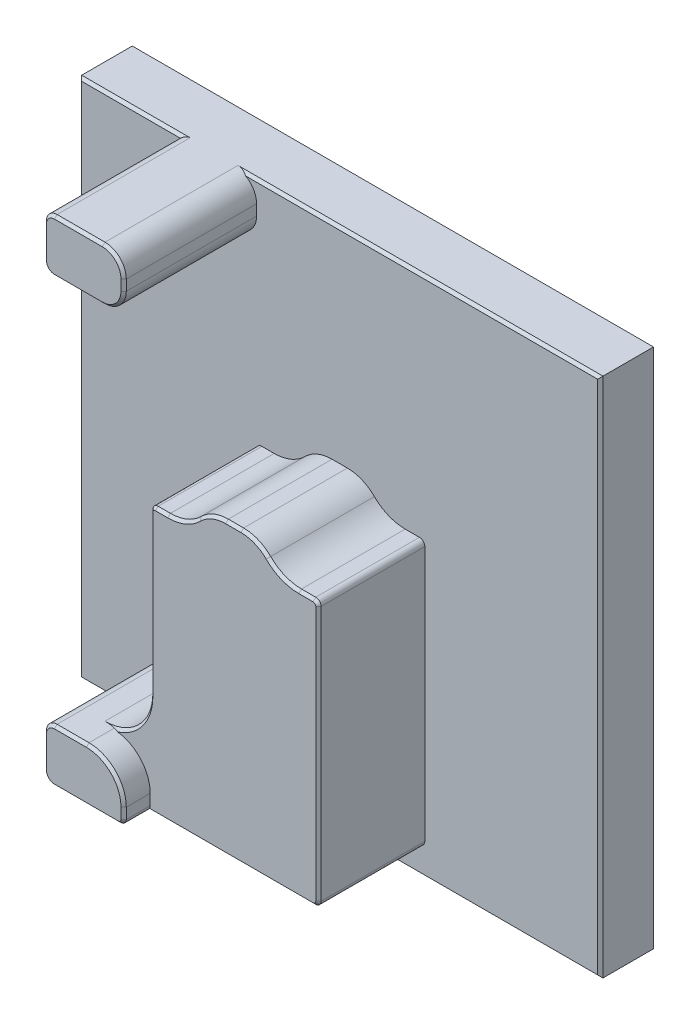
ISO-10303-21;
HEADER;
FILE_DESCRIPTION(('STEP AP214'),'2;1');
FILE_NAME('part.step','',(''),(''),'','','');
FILE_SCHEMA(('AUTOMOTIVE_DESIGN { 1 0 10303 214 1 1 1 1 }'));
ENDSEC;
DATA;
#1=APPLICATION_CONTEXT('core data for automotive mechanical design processes');
#2=APPLICATION_PROTOCOL_DEFINITION('international standard','automotive_design',2000,#1);
#3=PRODUCT_CONTEXT('',#1,'mechanical');
#4=PRODUCT('Part','Part','',(#3));
#5=PRODUCT_RELATED_PRODUCT_CATEGORY('part','',(#4));
#6=PRODUCT_DEFINITION_FORMATION('','',#4);
#7=PRODUCT_DEFINITION_CONTEXT('part definition',#1,'design');
#8=PRODUCT_DEFINITION('design','',#6,#7);
#9=PRODUCT_DEFINITION_SHAPE('','',#8);
#10=(LENGTH_UNIT() NAMED_UNIT(*) SI_UNIT(.MILLI.,.METRE.));
#11=(NAMED_UNIT(*) PLANE_ANGLE_UNIT() SI_UNIT($,.RADIAN.));
#12=(NAMED_UNIT(*) SI_UNIT($,.STERADIAN.) SOLID_ANGLE_UNIT());
#13=UNCERTAINTY_MEASURE_WITH_UNIT(LENGTH_MEASURE(1.E-05),#10,'distance_accuracy_value','');
#14=(GEOMETRIC_REPRESENTATION_CONTEXT(3) GLOBAL_UNCERTAINTY_ASSIGNED_CONTEXT((#13)) GLOBAL_UNIT_ASSIGNED_CONTEXT((#10,
#11,#12)) REPRESENTATION_CONTEXT('',''));
#15=CARTESIAN_POINT('',(0.,0.,0.));
#16=DIRECTION('',(0.,0.,1.));
#17=DIRECTION('',(1.,0.,0.));
#18=AXIS2_PLACEMENT_3D('',#15,#16,#17);
#19=CARTESIAN_POINT('',(0.,0.,35.));
#20=DIRECTION('',(1.,0.,0.));
#21=DIRECTION('',(0.,0.,-1.));
#22=AXIS2_PLACEMENT_3D('',#19,#20,#21);
#23=PLANE('',#22);
#24=DIRECTION('',(0.,0.,-1.));
#25=VECTOR('',#24,1.);
#26=CARTESIAN_POINT('',(0.,0.,35.));
#27=LINE('',#26,#25);
#28=CARTESIAN_POINT('',(0.,0.,9.49999999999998));
#29=VERTEX_POINT('',#28);
#30=CARTESIAN_POINT('',(0.,0.,0.));
#31=VERTEX_POINT('',#30);
#32=EDGE_CURVE('E366',#29,#31,#27,.T.);
#33=ORIENTED_EDGE('',*,*,#32,.F.);
#34=DIRECTION('',(0.,1.,0.));
#35=VECTOR('',#34,1.);
#36=CARTESIAN_POINT('',(0.,98.,9.49999999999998));
#37=LINE('',#36,#35);
#38=CARTESIAN_POINT('',(0.,98.,9.49999999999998));
#39=VERTEX_POINT('',#38);
#40=EDGE_CURVE('E656',#29,#39,#37,.T.);
#41=ORIENTED_EDGE('',*,*,#40,.T.);
#42=DIRECTION('',(0.,0.,-1.));
#43=VECTOR('',#42,1.);
#44=CARTESIAN_POINT('',(0.,98.,35.));
#45=LINE('',#44,#43);
#46=CARTESIAN_POINT('',(0.,98.,0.));
#47=VERTEX_POINT('',#46);
#48=EDGE_CURVE('E386',#39,#47,#45,.T.);
#49=ORIENTED_EDGE('',*,*,#48,.T.);
#50=DIRECTION('',(0.,-1.,0.));
#51=VECTOR('',#50,1.);
#52=CARTESIAN_POINT('',(0.,0.,0.));
#53=LINE('',#52,#51);
#54=EDGE_CURVE('E381',#47,#31,#53,.T.);
#55=ORIENTED_EDGE('',*,*,#54,.T.);
#56=EDGE_LOOP('',(#33,#41,#49,#55));
#57=FACE_BOUND('',#56,.T.);
#58=ADVANCED_FACE('F33',(#57),#23,.F.);
#59=CARTESIAN_POINT('',(0.,0.,35.));
#60=DIRECTION('',(0.,0.,-1.));
#61=DIRECTION('',(-1.,0.,0.));
#62=AXIS2_PLACEMENT_3D('',#59,#60,#61);
#63=PLANE('',#62);
#64=DIRECTION('',(0.,1.,0.));
#65=VECTOR('',#64,1.);
#66=CARTESIAN_POINT('',(32.875,0.,35.));
#67=LINE('',#66,#65);
#68=CARTESIAN_POINT('',(32.875,92.,35.));
#69=VERTEX_POINT('',#68);
#70=CARTESIAN_POINT('',(32.875,94.,35.));
#71=VERTEX_POINT('',#70);
#72=EDGE_CURVE('E561',#69,#71,#67,.T.);
#73=ORIENTED_EDGE('',*,*,#72,.T.);
#74=CARTESIAN_POINT('',(29.375,94.,35.));
#75=DIRECTION('',(0.,0.,-1.));
#76=DIRECTION('',(-1.,0.,0.));
#77=AXIS2_PLACEMENT_3D('',#74,#75,#76);
#78=CIRCLE('',#77,3.49999999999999);
#79=CARTESIAN_POINT('',(29.375,97.5,35.));
#80=VERTEX_POINT('',#79);
#81=EDGE_CURVE('E563',#71,#80,#78,.F.);
#82=ORIENTED_EDGE('',*,*,#81,.T.);
#83=DIRECTION('',(-1.,0.,0.));
#84=VECTOR('',#83,1.);
#85=CARTESIAN_POINT('',(0.,97.5,35.));
#86=LINE('',#85,#84);
#87=CARTESIAN_POINT('',(20.375,97.5,35.));
#88=VERTEX_POINT('',#87);
#89=EDGE_CURVE('E549',#80,#88,#86,.T.);
#90=ORIENTED_EDGE('',*,*,#89,.T.);
#91=CARTESIAN_POINT('',(20.375,96.,35.));
#92=DIRECTION('',(0.,0.,-1.));
#93=DIRECTION('',(-1.,0.,0.));
#94=AXIS2_PLACEMENT_3D('',#91,#92,#93);
#95=CIRCLE('',#94,1.49999999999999);
#96=CARTESIAN_POINT('',(18.875,96.,35.));
#97=VERTEX_POINT('',#96);
#98=EDGE_CURVE('E551',#88,#97,#95,.F.);
#99=ORIENTED_EDGE('',*,*,#98,.T.);
#100=DIRECTION('',(0.,-1.,0.));
#101=VECTOR('',#100,1.);
#102=CARTESIAN_POINT('',(18.875,0.,35.));
#103=LINE('',#102,#101);
#104=CARTESIAN_POINT('',(18.875,90.,35.));
#105=VERTEX_POINT('',#104);
#106=EDGE_CURVE('E553',#97,#105,#103,.T.);
#107=ORIENTED_EDGE('',*,*,#106,.T.);
#108=CARTESIAN_POINT('',(20.375,90.,35.));
#109=DIRECTION('',(0.,0.,-1.));
#110=DIRECTION('',(-1.,0.,0.));
#111=AXIS2_PLACEMENT_3D('',#108,#109,#110);
#112=CIRCLE('',#111,1.49999999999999);
#113=CARTESIAN_POINT('',(20.375,88.5,35.));
#114=VERTEX_POINT('',#113);
#115=EDGE_CURVE('E555',#105,#114,#112,.F.);
#116=ORIENTED_EDGE('',*,*,#115,.T.);
#117=DIRECTION('',(1.,0.,0.));
#118=VECTOR('',#117,1.);
#119=CARTESIAN_POINT('',(0.,88.5,35.));
#120=LINE('',#119,#118);
#121=CARTESIAN_POINT('',(29.375,88.5,35.));
#122=VERTEX_POINT('',#121);
#123=EDGE_CURVE('E557',#114,#122,#120,.T.);
#124=ORIENTED_EDGE('',*,*,#123,.T.);
#125=CARTESIAN_POINT('',(29.375,92.,35.));
#126=DIRECTION('',(0.,0.,-1.));
#127=DIRECTION('',(-1.,0.,0.));
#128=AXIS2_PLACEMENT_3D('',#125,#126,#127);
#129=CIRCLE('',#128,3.49999999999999);
#130=EDGE_CURVE('E559',#122,#69,#129,.F.);
#131=ORIENTED_EDGE('',*,*,#130,.T.);
#132=EDGE_LOOP('',(#73,#82,#90,#99,#107,#116,#124,#131));
#133=FACE_BOUND('',#132,.T.);
#134=ADVANCED_FACE('F805',(#133),#63,.F.);
#135=CARTESIAN_POINT('',(33.375,5.,9.99999999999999));
#136=DIRECTION('',(-1.,0.,0.));
#137=DIRECTION('',(0.,0.,1.));
#138=AXIS2_PLACEMENT_3D('',#135,#136,#137);
#139=PLANE('',#138);
#140=DIRECTION('',(0.,0.,1.));
#141=VECTOR('',#140,1.);
#142=CARTESIAN_POINT('',(33.375,94.,9.99999999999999));
#143=LINE('',#142,#141);
#144=CARTESIAN_POINT('',(33.375,94.,9.99999999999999));
#145=VERTEX_POINT('',#144);
#146=CARTESIAN_POINT('',(33.375,94.,34.5));
#147=VERTEX_POINT('',#146);
#148=EDGE_CURVE('E441',#145,#147,#143,.T.);
#149=ORIENTED_EDGE('',*,*,#148,.T.);
#150=DIRECTION('',(0.,-1.,0.));
#151=VECTOR('',#150,1.);
#152=CARTESIAN_POINT('',(33.375,5.,34.5));
#153=LINE('',#152,#151);
#154=CARTESIAN_POINT('',(33.375,92.,34.5));
#155=VERTEX_POINT('',#154);
#156=EDGE_CURVE('E569',#147,#155,#153,.T.);
#157=ORIENTED_EDGE('',*,*,#156,.T.);
#158=DIRECTION('',(0.,0.,1.));
#159=VECTOR('',#158,1.);
#160=CARTESIAN_POINT('',(33.375,92.,9.99999999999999));
#161=LINE('',#160,#159);
#162=CARTESIAN_POINT('',(33.375,92.,9.99999999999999));
#163=VERTEX_POINT('',#162);
#164=EDGE_CURVE('E439',#155,#163,#161,.F.);
#165=ORIENTED_EDGE('',*,*,#164,.T.);
#166=DIRECTION('',(0.,-1.,0.));
#167=VECTOR('',#166,1.);
#168=CARTESIAN_POINT('',(33.375,98.,9.99999999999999));
#169=LINE('',#168,#167);
#170=EDGE_CURVE('E1005',#145,#163,#169,.T.);
#171=ORIENTED_EDGE('',*,*,#170,.F.);
#172=EDGE_LOOP('',(#149,#157,#165,#171));
#173=FACE_BOUND('',#172,.T.);
#174=ADVANCED_FACE('F810',(#173),#139,.F.);
#175=CARTESIAN_POINT('',(0.,0.,35.));
#176=DIRECTION('',(0.,1.,0.));
#177=DIRECTION('',(0.,0.,1.));
#178=AXIS2_PLACEMENT_3D('',#175,#176,#177);
#179=PLANE('',#178);
#180=DIRECTION('',(0.,0.,-1.));
#181=VECTOR('',#180,1.);
#182=CARTESIAN_POINT('',(98.,0.,35.));
#183=LINE('',#182,#181);
#184=CARTESIAN_POINT('',(98.,0.,9.49999999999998));
#185=VERTEX_POINT('',#184);
#186=CARTESIAN_POINT('',(98.,0.,0.));
#187=VERTEX_POINT('',#186);
#188=EDGE_CURVE('E375',#185,#187,#183,.T.);
#189=ORIENTED_EDGE('',*,*,#188,.F.);
#190=DIRECTION('',(-1.,0.,0.));
#191=VECTOR('',#190,1.);
#192=CARTESIAN_POINT('',(0.,0.,9.49999999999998));
#193=LINE('',#192,#191);
#194=EDGE_CURVE('E58',#185,#29,#193,.T.);
#195=ORIENTED_EDGE('',*,*,#194,.T.);
#196=ORIENTED_EDGE('',*,*,#32,.T.);
#197=DIRECTION('',(1.,0.,0.));
#198=VECTOR('',#197,1.);
#199=CARTESIAN_POINT('',(0.,0.,0.));
#200=LINE('',#199,#198);
#201=EDGE_CURVE('E369',#31,#187,#200,.T.);
#202=ORIENTED_EDGE('',*,*,#201,.T.);
#203=EDGE_LOOP('',(#189,#195,#196,#202));
#204=FACE_BOUND('',#203,.T.);
#205=ADVANCED_FACE('F368',(#204),#179,.F.);
#206=CARTESIAN_POINT('',(65.,5.00000000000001,9.99999999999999));
#207=DIRECTION('',(0.,1.,0.));
#208=DIRECTION('',(-1.,0.,0.));
#209=AXIS2_PLACEMENT_3D('',#206,#207,#208);
#210=PLANE('',#209);
#211=DIRECTION('',(0.,0.,1.));
#212=VECTOR('',#211,1.);
#213=CARTESIAN_POINT('',(32.375,5.,9.99999999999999));
#214=LINE('',#213,#212);
#215=CARTESIAN_POINT('',(32.375,5.,29.5));
#216=VERTEX_POINT('',#215);
#217=CARTESIAN_POINT('',(32.375,5.,34.5));
#218=VERTEX_POINT('',#217);
#219=EDGE_CURVE('E491',#216,#218,#214,.T.);
#220=ORIENTED_EDGE('',*,*,#219,.T.);
#221=DIRECTION('',(-1.,0.,0.));
#222=VECTOR('',#221,1.);
#223=CARTESIAN_POINT('',(65.,5.00000000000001,34.5));
#224=LINE('',#223,#222);
#225=CARTESIAN_POINT('',(20.375,5.,34.5));
#226=VERTEX_POINT('',#225);
#227=EDGE_CURVE('E535',#218,#226,#224,.T.);
#228=ORIENTED_EDGE('',*,*,#227,.T.);
#229=DIRECTION('',(0.,0.,1.));
#230=VECTOR('',#229,1.);
#231=CARTESIAN_POINT('',(20.375,5.,9.99999999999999));
#232=LINE('',#231,#230);
#233=CARTESIAN_POINT('',(20.375,5.,9.99999999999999));
#234=VERTEX_POINT('',#233);
#235=EDGE_CURVE('E459',#226,#234,#232,.F.);
#236=ORIENTED_EDGE('',*,*,#235,.T.);
#237=DIRECTION('',(-1.,0.,0.));
#238=VECTOR('',#237,1.);
#239=CARTESIAN_POINT('',(65.,5.00000000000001,9.99999999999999));
#240=LINE('',#239,#238);
#241=CARTESIAN_POINT('',(64.,5.00000000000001,9.99999999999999));
#242=VERTEX_POINT('',#241);
#243=EDGE_CURVE('E388',#242,#234,#240,.T.);
#244=ORIENTED_EDGE('',*,*,#243,.F.);
#245=DIRECTION('',(0.,0.,1.));
#246=VECTOR('',#245,1.);
#247=CARTESIAN_POINT('',(64.,5.00000000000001,9.99999999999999));
#248=LINE('',#247,#246);
#249=CARTESIAN_POINT('',(64.,5.00000000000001,29.5));
#250=VERTEX_POINT('',#249);
#251=EDGE_CURVE('E411',#242,#250,#248,.T.);
#252=ORIENTED_EDGE('',*,*,#251,.T.);
#253=DIRECTION('',(-1.,0.,0.));
#254=VECTOR('',#253,1.);
#255=CARTESIAN_POINT('',(32.375,5.,29.5));
#256=LINE('',#255,#254);
#257=EDGE_CURVE('E532',#250,#216,#256,.T.);
#258=ORIENTED_EDGE('',*,*,#257,.T.);
#259=EDGE_LOOP('',(#220,#228,#236,#244,#252,#258));
#260=FACE_BOUND('',#259,.T.);
#261=ADVANCED_FACE('F1035',(#260),#210,.F.);
#262=CARTESIAN_POINT('',(65.,55.,9.99999999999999));
#263=DIRECTION('',(-1.,0.,0.));
#264=DIRECTION('',(0.,-1.,0.));
#265=AXIS2_PLACEMENT_3D('',#262,#263,#264);
#266=PLANE('',#265);
#267=DIRECTION('',(0.,0.,1.));
#268=VECTOR('',#267,1.);
#269=CARTESIAN_POINT('',(65.,54.,9.99999999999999));
#270=LINE('',#269,#268);
#271=CARTESIAN_POINT('',(65.,54.,9.99999999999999));
#272=VERTEX_POINT('',#271);
#273=CARTESIAN_POINT('',(65.,54.,29.5));
#274=VERTEX_POINT('',#273);
#275=EDGE_CURVE('E414',#272,#274,#270,.T.);
#276=ORIENTED_EDGE('',*,*,#275,.T.);
#277=DIRECTION('',(0.,-1.,0.));
#278=VECTOR('',#277,1.);
#279=CARTESIAN_POINT('',(65.,6.00000000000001,29.5));
#280=LINE('',#279,#278);
#281=CARTESIAN_POINT('',(65.,6.00000000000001,29.5));
#282=VERTEX_POINT('',#281);
#283=EDGE_CURVE('E619',#274,#282,#280,.T.);
#284=ORIENTED_EDGE('',*,*,#283,.T.);
#285=DIRECTION('',(0.,0.,1.));
#286=VECTOR('',#285,1.);
#287=CARTESIAN_POINT('',(65.,6.00000000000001,9.99999999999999));
#288=LINE('',#287,#286);
#289=CARTESIAN_POINT('',(65.,6.00000000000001,9.99999999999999));
#290=VERTEX_POINT('',#289);
#291=EDGE_CURVE('E417',#282,#290,#288,.F.);
#292=ORIENTED_EDGE('',*,*,#291,.T.);
#293=DIRECTION('',(0.,-1.,0.));
#294=VECTOR('',#293,1.);
#295=CARTESIAN_POINT('',(65.,55.,9.99999999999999));
#296=LINE('',#295,#294);
#297=EDGE_CURVE('E391',#272,#290,#296,.T.);
#298=ORIENTED_EDGE('',*,*,#297,.F.);
#299=EDGE_LOOP('',(#276,#284,#292,#298));
#300=FACE_BOUND('',#299,.T.);
#301=ADVANCED_FACE('F1144',(#300),#266,.F.);
#302=CARTESIAN_POINT('',(54.,55.,9.99999999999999));
#303=DIRECTION('',(0.,-1.,0.));
#304=DIRECTION('',(0.,0.,-1.));
#305=AXIS2_PLACEMENT_3D('',#302,#303,#304);
#306=PLANE('',#305);
#307=DIRECTION('',(0.,0.,1.));
#308=VECTOR('',#307,1.);
#309=CARTESIAN_POINT('',(61.3177865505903,55.,9.99999999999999));
#310=LINE('',#309,#308);
#311=CARTESIAN_POINT('',(61.3177865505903,55.,9.99999999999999));
#312=VERTEX_POINT('',#311);
#313=CARTESIAN_POINT('',(61.3177865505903,55.,29.5));
#314=VERTEX_POINT('',#313);
#315=EDGE_CURVE('E374',#312,#314,#310,.T.);
#316=ORIENTED_EDGE('',*,*,#315,.T.);
#317=DIRECTION('',(1.,0.,0.));
#318=VECTOR('',#317,1.);
#319=CARTESIAN_POINT('',(64.,55.,29.5));
#320=LINE('',#319,#318);
#321=CARTESIAN_POINT('',(64.,55.,29.5));
#322=VERTEX_POINT('',#321);
#323=EDGE_CURVE('E623',#314,#322,#320,.T.);
#324=ORIENTED_EDGE('',*,*,#323,.T.);
#325=DIRECTION('',(0.,0.,1.));
#326=VECTOR('',#325,1.);
#327=CARTESIAN_POINT('',(64.,55.,9.99999999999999));
#328=LINE('',#327,#326);
#329=CARTESIAN_POINT('',(64.,55.,9.99999999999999));
#330=VERTEX_POINT('',#329);
#331=EDGE_CURVE('E419',#322,#330,#328,.F.);
#332=ORIENTED_EDGE('',*,*,#331,.T.);
#333=DIRECTION('',(1.,0.,0.));
#334=VECTOR('',#333,1.);
#335=CARTESIAN_POINT('',(54.,55.,9.99999999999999));
#336=LINE('',#335,#334);
#337=EDGE_CURVE('E1019',#312,#330,#336,.T.);
#338=ORIENTED_EDGE('',*,*,#337,.F.);
#339=EDGE_LOOP('',(#316,#324,#332,#338));
#340=FACE_BOUND('',#339,.T.);
#341=ADVANCED_FACE('F1134',(#340),#306,.F.);
#342=CARTESIAN_POINT('',(44.,59.5,9.99999999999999));
#343=DIRECTION('',(0.,-1.,0.));
#344=DIRECTION('',(0.,0.,-1.));
#345=AXIS2_PLACEMENT_3D('',#342,#343,#344);
#346=PLANE('',#345);
#347=DIRECTION('',(0.,0.,-1.));
#348=VECTOR('',#347,1.);
#349=CARTESIAN_POINT('',(47.561092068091,59.5,9.99999999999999));
#350=LINE('',#349,#348);
#351=CARTESIAN_POINT('',(47.561092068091,59.5,9.99999999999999));
#352=VERTEX_POINT('',#351);
#353=CARTESIAN_POINT('',(47.561092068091,59.5,29.5));
#354=VERTEX_POINT('',#353);
#355=EDGE_CURVE('E428',#352,#354,#350,.F.);
#356=ORIENTED_EDGE('',*,*,#355,.T.);
#357=DIRECTION('',(1.,0.,0.));
#358=VECTOR('',#357,1.);
#359=CARTESIAN_POINT('',(50.438907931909,59.5,29.5));
#360=LINE('',#359,#358);
#361=CARTESIAN_POINT('',(50.438907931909,59.5,29.5));
#362=VERTEX_POINT('',#361);
#363=EDGE_CURVE('E629',#354,#362,#360,.T.);
#364=ORIENTED_EDGE('',*,*,#363,.T.);
#365=DIRECTION('',(0.,0.,1.));
#366=VECTOR('',#365,1.);
#367=CARTESIAN_POINT('',(50.438907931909,59.5,9.99999999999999));
#368=LINE('',#367,#366);
#369=CARTESIAN_POINT('',(50.438907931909,59.5,9.99999999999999));
#370=VERTEX_POINT('',#369);
#371=EDGE_CURVE('E431',#362,#370,#368,.F.);
#372=ORIENTED_EDGE('',*,*,#371,.T.);
#373=DIRECTION('',(1.,0.,0.));
#374=VECTOR('',#373,1.);
#375=CARTESIAN_POINT('',(44.,59.5,9.99999999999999));
#376=LINE('',#375,#374);
#377=EDGE_CURVE('E1011',#352,#370,#376,.T.);
#378=ORIENTED_EDGE('',*,*,#377,.F.);
#379=EDGE_LOOP('',(#356,#364,#372,#378));
#380=FACE_BOUND('',#379,.T.);
#381=ADVANCED_FACE('F1123',(#380),#346,.F.);
#382=CARTESIAN_POINT('',(33.375,55.,9.99999999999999));
#383=DIRECTION('',(0.,-1.,0.));
#384=DIRECTION('',(0.,0.,-1.));
#385=AXIS2_PLACEMENT_3D('',#382,#383,#384);
#386=PLANE('',#385);
#387=DIRECTION('',(0.,0.,1.));
#388=VECTOR('',#387,1.);
#389=CARTESIAN_POINT('',(34.375,55.,9.99999999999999));
#390=LINE('',#389,#388);
#391=CARTESIAN_POINT('',(34.375,55.,9.99999999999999));
#392=VERTEX_POINT('',#391);
#393=CARTESIAN_POINT('',(34.375,55.,29.5));
#394=VERTEX_POINT('',#393);
#395=EDGE_CURVE('E484',#392,#394,#390,.T.);
#396=ORIENTED_EDGE('',*,*,#395,.T.);
#397=DIRECTION('',(1.,0.,0.));
#398=VECTOR('',#397,1.);
#399=CARTESIAN_POINT('',(36.6822134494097,55.,29.5));
#400=LINE('',#399,#398);
#401=CARTESIAN_POINT('',(36.6822134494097,55.,29.5));
#402=VERTEX_POINT('',#401);
#403=EDGE_CURVE('E635',#394,#402,#400,.T.);
#404=ORIENTED_EDGE('',*,*,#403,.T.);
#405=DIRECTION('',(0.,0.,-1.));
#406=VECTOR('',#405,1.);
#407=CARTESIAN_POINT('',(36.6822134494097,55.,9.99999999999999));
#408=LINE('',#407,#406);
#409=CARTESIAN_POINT('',(36.6822134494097,55.,9.99999999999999));
#410=VERTEX_POINT('',#409);
#411=EDGE_CURVE('E409',#402,#410,#408,.T.);
#412=ORIENTED_EDGE('',*,*,#411,.T.);
#413=DIRECTION('',(1.,0.,0.));
#414=VECTOR('',#413,1.);
#415=CARTESIAN_POINT('',(33.375,55.,9.99999999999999));
#416=LINE('',#415,#414);
#417=EDGE_CURVE('E1007',#392,#410,#416,.T.);
#418=ORIENTED_EDGE('',*,*,#417,.F.);
#419=EDGE_LOOP('',(#396,#404,#412,#418));
#420=FACE_BOUND('',#419,.T.);
#421=ADVANCED_FACE('F1104',(#420),#386,.F.);
#422=CARTESIAN_POINT('',(98.,0.,35.));
#423=DIRECTION('',(-1.,0.,0.));
#424=DIRECTION('',(0.,0.,1.));
#425=AXIS2_PLACEMENT_3D('',#422,#423,#424);
#426=PLANE('',#425);
#427=DIRECTION('',(0.,0.,-1.));
#428=VECTOR('',#427,1.);
#429=CARTESIAN_POINT('',(98.,98.,35.));
#430=LINE('',#429,#428);
#431=CARTESIAN_POINT('',(98.,98.,9.49999999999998));
#432=VERTEX_POINT('',#431);
#433=CARTESIAN_POINT('',(98.,98.,0.));
#434=VERTEX_POINT('',#433);
#435=EDGE_CURVE('E399',#432,#434,#430,.T.);
#436=ORIENTED_EDGE('',*,*,#435,.F.);
#437=DIRECTION('',(0.,-1.,0.));
#438=VECTOR('',#437,1.);
#439=CARTESIAN_POINT('',(98.,0.,9.49999999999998));
#440=LINE('',#439,#438);
#441=EDGE_CURVE('E653',#432,#185,#440,.T.);
#442=ORIENTED_EDGE('',*,*,#441,.T.);
#443=ORIENTED_EDGE('',*,*,#188,.T.);
#444=DIRECTION('',(0.,1.,0.));
#445=VECTOR('',#444,1.);
#446=CARTESIAN_POINT('',(98.,0.,0.));
#447=LINE('',#446,#445);
#448=EDGE_CURVE('E383',#187,#434,#447,.T.);
#449=ORIENTED_EDGE('',*,*,#448,.T.);
#450=EDGE_LOOP('',(#436,#442,#443,#449));
#451=FACE_BOUND('',#450,.T.);
#452=ADVANCED_FACE('F1160',(#451),#426,.F.);
#453=CARTESIAN_POINT('',(0.,98.,35.));
#454=DIRECTION('',(0.,-1.,0.));
#455=DIRECTION('',(0.,0.,-1.));
#456=AXIS2_PLACEMENT_3D('',#453,#454,#455);
#457=PLANE('',#456);
#458=DIRECTION('',(0.,0.,1.));
#459=VECTOR('',#458,1.);
#460=CARTESIAN_POINT('',(20.375,98.,35.));
#461=LINE('',#460,#459);
#462=CARTESIAN_POINT('',(20.375,98.,9.49999999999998));
#463=VERTEX_POINT('',#462);
#464=CARTESIAN_POINT('',(20.375,98.,34.5));
#465=VERTEX_POINT('',#464);
#466=EDGE_CURVE('E464',#463,#465,#461,.T.);
#467=ORIENTED_EDGE('',*,*,#466,.T.);
#468=DIRECTION('',(1.,0.,0.));
#469=VECTOR('',#468,1.);
#470=CARTESIAN_POINT('',(0.,98.,34.5));
#471=LINE('',#470,#469);
#472=CARTESIAN_POINT('',(29.375,98.,34.5));
#473=VERTEX_POINT('',#472);
#474=EDGE_CURVE('E586',#465,#473,#471,.T.);
#475=ORIENTED_EDGE('',*,*,#474,.T.);
#476=DIRECTION('',(0.,0.,1.));
#477=VECTOR('',#476,1.);
#478=CARTESIAN_POINT('',(29.375,98.,35.));
#479=LINE('',#478,#477);
#480=CARTESIAN_POINT('',(29.375,98.,9.49999999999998));
#481=VERTEX_POINT('',#480);
#482=EDGE_CURVE('E444',#473,#481,#479,.F.);
#483=ORIENTED_EDGE('',*,*,#482,.T.);
#484=DIRECTION('',(1.,0.,0.));
#485=VECTOR('',#484,1.);
#486=CARTESIAN_POINT('',(98.,98.,9.49999999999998));
#487=LINE('',#486,#485);
#488=EDGE_CURVE('E581',#481,#432,#487,.T.);
#489=ORIENTED_EDGE('',*,*,#488,.T.);
#490=ORIENTED_EDGE('',*,*,#435,.T.);
#491=DIRECTION('',(-1.,0.,0.));
#492=VECTOR('',#491,1.);
#493=CARTESIAN_POINT('',(0.,98.,0.));
#494=LINE('',#493,#492);
#495=EDGE_CURVE('E396',#434,#47,#494,.T.);
#496=ORIENTED_EDGE('',*,*,#495,.T.);
#497=ORIENTED_EDGE('',*,*,#48,.F.);
#498=DIRECTION('',(1.,0.,0.));
#499=VECTOR('',#498,1.);
#500=CARTESIAN_POINT('',(20.375,98.,9.49999999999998));
#501=LINE('',#500,#499);
#502=EDGE_CURVE('E583',#39,#463,#501,.T.);
#503=ORIENTED_EDGE('',*,*,#502,.T.);
#504=EDGE_LOOP('',(#467,#475,#483,#489,#490,#496,#497,#503));
#505=FACE_BOUND('',#504,.T.);
#506=ADVANCED_FACE('F1163',(#505),#457,.F.);
#507=DIRECTION('',(1.,0.,0.));
#508=VECTOR('',#507,1.);
#509=CARTESIAN_POINT('',(0.,5.5,35.));
#510=LINE('',#509,#508);
#511=CARTESIAN_POINT('',(20.375,5.49999999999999,35.));
#512=VERTEX_POINT('',#511);
#513=CARTESIAN_POINT('',(32.375,5.5,35.));
#514=VERTEX_POINT('',#513);
#515=EDGE_CURVE('E524',#512,#514,#510,.T.);
#516=ORIENTED_EDGE('',*,*,#515,.T.);
#517=CARTESIAN_POINT('',(32.375,6.,35.));
#518=DIRECTION('',(0.,0.,-1.));
#519=DIRECTION('',(-1.,0.,0.));
#520=AXIS2_PLACEMENT_3D('',#517,#518,#519);
#521=CIRCLE('',#520,0.5);
#522=CARTESIAN_POINT('',(32.875,6.,35.));
#523=VERTEX_POINT('',#522);
#524=EDGE_CURVE('E526',#514,#523,#521,.F.);
#525=ORIENTED_EDGE('',*,*,#524,.T.);
#526=DIRECTION('',(0.,1.,0.));
#527=VECTOR('',#526,1.);
#528=CARTESIAN_POINT('',(32.875,0.,35.));
#529=LINE('',#528,#527);
#530=CARTESIAN_POINT('',(32.875,8.,35.));
#531=VERTEX_POINT('',#530);
#532=EDGE_CURVE('E512',#523,#531,#529,.T.);
#533=ORIENTED_EDGE('',*,*,#532,.T.);
#534=CARTESIAN_POINT('',(26.375,8.,35.));
#535=DIRECTION('',(0.,0.,-1.));
#536=DIRECTION('',(-1.,0.,0.));
#537=AXIS2_PLACEMENT_3D('',#534,#535,#536);
#538=CIRCLE('',#537,6.5);
#539=CARTESIAN_POINT('',(26.375,14.5,35.));
#540=VERTEX_POINT('',#539);
#541=EDGE_CURVE('E514',#531,#540,#538,.F.);
#542=ORIENTED_EDGE('',*,*,#541,.T.);
#543=DIRECTION('',(-1.,0.,0.));
#544=VECTOR('',#543,1.);
#545=CARTESIAN_POINT('',(0.,14.5,35.));
#546=LINE('',#545,#544);
#547=CARTESIAN_POINT('',(20.375,14.5,35.));
#548=VERTEX_POINT('',#547);
#549=EDGE_CURVE('E516',#540,#548,#546,.T.);
#550=ORIENTED_EDGE('',*,*,#549,.T.);
#551=CARTESIAN_POINT('',(20.375,13.,35.));
#552=DIRECTION('',(0.,0.,-1.));
#553=DIRECTION('',(-1.,0.,0.));
#554=AXIS2_PLACEMENT_3D('',#551,#552,#553);
#555=CIRCLE('',#554,1.50000000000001);
#556=CARTESIAN_POINT('',(18.875,13.,35.));
#557=VERTEX_POINT('',#556);
#558=EDGE_CURVE('E518',#548,#557,#555,.F.);
#559=ORIENTED_EDGE('',*,*,#558,.T.);
#560=DIRECTION('',(0.,-1.,0.));
#561=VECTOR('',#560,1.);
#562=CARTESIAN_POINT('',(18.875,0.,35.));
#563=LINE('',#562,#561);
#564=CARTESIAN_POINT('',(18.875,7.,35.));
#565=VERTEX_POINT('',#564);
#566=EDGE_CURVE('E520',#557,#565,#563,.T.);
#567=ORIENTED_EDGE('',*,*,#566,.T.);
#568=CARTESIAN_POINT('',(20.375,7.,35.));
#569=DIRECTION('',(0.,0.,-1.));
#570=DIRECTION('',(-1.,0.,0.));
#571=AXIS2_PLACEMENT_3D('',#568,#569,#570);
#572=CIRCLE('',#571,1.50000000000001);
#573=EDGE_CURVE('E522',#565,#512,#572,.F.);
#574=ORIENTED_EDGE('',*,*,#573,.T.);
#575=EDGE_LOOP('',(#516,#525,#533,#542,#550,#559,#567,#574));
#576=FACE_BOUND('',#575,.T.);
#577=ADVANCED_FACE('F813',(#576),#63,.F.);
#578=CARTESIAN_POINT('',(0.,0.,0.));
#579=DIRECTION('',(0.,0.,-1.));
#580=DIRECTION('',(-1.,0.,0.));
#581=AXIS2_PLACEMENT_3D('',#578,#579,#580);
#582=PLANE('',#581);
#583=ORIENTED_EDGE('',*,*,#54,.F.);
#584=ORIENTED_EDGE('',*,*,#495,.F.);
#585=ORIENTED_EDGE('',*,*,#448,.F.);
#586=ORIENTED_EDGE('',*,*,#201,.F.);
#587=EDGE_LOOP('',(#583,#584,#585,#586));
#588=FACE_BOUND('',#587,.T.);
#589=ADVANCED_FACE('F379',(#588),#582,.T.);
#590=DIRECTION('',(0.,0.,1.));
#591=VECTOR('',#590,1.);
#592=CARTESIAN_POINT('',(33.375,8.,9.99999999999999));
#593=LINE('',#592,#591);
#594=CARTESIAN_POINT('',(33.375,8.,30.));
#595=VERTEX_POINT('',#594);
#596=CARTESIAN_POINT('',(33.375,8.,34.5));
#597=VERTEX_POINT('',#596);
#598=EDGE_CURVE('E506',#595,#597,#593,.T.);
#599=ORIENTED_EDGE('',*,*,#598,.T.);
#600=DIRECTION('',(0.,-1.,0.));
#601=VECTOR('',#600,1.);
#602=CARTESIAN_POINT('',(33.375,5.,34.5));
#603=LINE('',#602,#601);
#604=CARTESIAN_POINT('',(33.375,6.,34.5));
#605=VERTEX_POINT('',#604);
#606=EDGE_CURVE('E547',#597,#605,#603,.T.);
#607=ORIENTED_EDGE('',*,*,#606,.T.);
#608=DIRECTION('',(0.,0.,1.));
#609=VECTOR('',#608,1.);
#610=CARTESIAN_POINT('',(33.375,6.,9.99999999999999));
#611=LINE('',#610,#609);
#612=CARTESIAN_POINT('',(33.375,6.,30.));
#613=VERTEX_POINT('',#612);
#614=EDGE_CURVE('E494',#605,#613,#611,.F.);
#615=ORIENTED_EDGE('',*,*,#614,.T.);
#616=DIRECTION('',(0.,-1.,0.));
#617=VECTOR('',#616,1.);
#618=CARTESIAN_POINT('',(33.375,5.,30.));
#619=LINE('',#618,#617);
#620=EDGE_CURVE('E1008',#595,#613,#619,.T.);
#621=ORIENTED_EDGE('',*,*,#620,.F.);
#622=EDGE_LOOP('',(#599,#607,#615,#621));
#623=FACE_BOUND('',#622,.T.);
#624=ADVANCED_FACE('F1044',(#623),#139,.F.);
#625=CARTESIAN_POINT('',(0.,0.,9.99999999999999));
#626=DIRECTION('',(0.,0.,1.));
#627=DIRECTION('',(1.,0.,0.));
#628=AXIS2_PLACEMENT_3D('',#625,#626,#627);
#629=PLANE('',#628);
#630=CARTESIAN_POINT('',(20.375,96.,9.99999999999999));
#631=DIRECTION('',(0.,0.,1.));
#632=DIRECTION('',(1.,0.,0.));
#633=AXIS2_PLACEMENT_3D('',#630,#631,#632);
#634=CIRCLE('',#633,2.);
#635=CARTESIAN_POINT('',(18.375,96.,9.99999999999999));
#636=VERTEX_POINT('',#635);
#637=CARTESIAN_POINT('',(19.0521243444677,97.5,9.99999999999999));
#638=VERTEX_POINT('',#637);
#639=EDGE_CURVE('E479',#636,#638,#634,.F.);
#640=ORIENTED_EDGE('',*,*,#639,.T.);
#641=DIRECTION('',(-1.,0.,0.));
#642=VECTOR('',#641,1.);
#643=CARTESIAN_POINT('',(0.,97.5,9.99999999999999));
#644=LINE('',#643,#642);
#645=CARTESIAN_POINT('',(0.500000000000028,97.5,9.99999999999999));
#646=VERTEX_POINT('',#645);
#647=EDGE_CURVE('E651',#638,#646,#644,.T.);
#648=ORIENTED_EDGE('',*,*,#647,.T.);
#649=DIRECTION('',(0.,-1.,0.));
#650=VECTOR('',#649,1.);
#651=CARTESIAN_POINT('',(0.500000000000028,0.,9.99999999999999));
#652=LINE('',#651,#650);
#653=CARTESIAN_POINT('',(0.500000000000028,0.500000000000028,9.99999999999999));
#654=VERTEX_POINT('',#653);
#655=EDGE_CURVE('E643',#646,#654,#652,.T.);
#656=ORIENTED_EDGE('',*,*,#655,.T.);
#657=DIRECTION('',(1.,0.,0.));
#658=VECTOR('',#657,1.);
#659=CARTESIAN_POINT('',(98.,0.500000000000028,9.99999999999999));
#660=LINE('',#659,#658);
#661=CARTESIAN_POINT('',(97.5,0.500000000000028,9.99999999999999));
#662=VERTEX_POINT('',#661);
#663=EDGE_CURVE('E645',#654,#662,#660,.T.);
#664=ORIENTED_EDGE('',*,*,#663,.T.);
#665=DIRECTION('',(0.,1.,0.));
#666=VECTOR('',#665,1.);
#667=CARTESIAN_POINT('',(97.5,98.,9.99999999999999));
#668=LINE('',#667,#666);
#669=CARTESIAN_POINT('',(97.5,97.5,9.99999999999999));
#670=VERTEX_POINT('',#669);
#671=EDGE_CURVE('E647',#662,#670,#668,.T.);
#672=ORIENTED_EDGE('',*,*,#671,.T.);
#673=DIRECTION('',(-1.,0.,0.));
#674=VECTOR('',#673,1.);
#675=CARTESIAN_POINT('',(29.375,97.5,9.99999999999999));
#676=LINE('',#675,#674);
#677=CARTESIAN_POINT('',(31.3114916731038,97.5,9.99999999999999));
#678=VERTEX_POINT('',#677);
#679=EDGE_CURVE('E649',#670,#678,#676,.T.);
#680=ORIENTED_EDGE('',*,*,#679,.T.);
#681=CARTESIAN_POINT('',(29.375,94.,9.99999999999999));
#682=DIRECTION('',(0.,0.,1.));
#683=DIRECTION('',(1.,0.,0.));
#684=AXIS2_PLACEMENT_3D('',#681,#682,#683);
#685=CIRCLE('',#684,4.);
#686=EDGE_CURVE('E449',#678,#145,#685,.F.);
#687=ORIENTED_EDGE('',*,*,#686,.T.);
#688=ORIENTED_EDGE('',*,*,#170,.T.);
#689=CARTESIAN_POINT('',(29.375,92.,9.99999999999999));
#690=DIRECTION('',(0.,0.,1.));
#691=DIRECTION('',(1.,0.,0.));
#692=AXIS2_PLACEMENT_3D('',#689,#690,#691);
#693=CIRCLE('',#692,4.);
#694=CARTESIAN_POINT('',(29.375,88.,9.99999999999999));
#695=VERTEX_POINT('',#694);
#696=EDGE_CURVE('E451',#163,#695,#693,.F.);
#697=ORIENTED_EDGE('',*,*,#696,.T.);
#698=DIRECTION('',(1.,0.,0.));
#699=VECTOR('',#698,1.);
#700=CARTESIAN_POINT('',(33.375,88.,9.99999999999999));
#701=LINE('',#700,#699);
#702=CARTESIAN_POINT('',(20.375,88.,9.99999999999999));
#703=VERTEX_POINT('',#702);
#704=EDGE_CURVE('E1074',#703,#695,#701,.T.);
#705=ORIENTED_EDGE('',*,*,#704,.F.);
#706=CARTESIAN_POINT('',(20.375,90.,9.99999999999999));
#707=DIRECTION('',(0.,0.,1.));
#708=DIRECTION('',(1.,0.,0.));
#709=AXIS2_PLACEMENT_3D('',#706,#707,#708);
#710=CIRCLE('',#709,2.);
#711=CARTESIAN_POINT('',(18.375,90.,9.99999999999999));
#712=VERTEX_POINT('',#711);
#713=EDGE_CURVE('E482',#703,#712,#710,.F.);
#714=ORIENTED_EDGE('',*,*,#713,.T.);
#715=DIRECTION('',(0.,-1.,0.));
#716=VECTOR('',#715,1.);
#717=CARTESIAN_POINT('',(18.375,88.,9.99999999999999));
#718=LINE('',#717,#716);
#719=EDGE_CURVE('E1072',#636,#712,#718,.T.);
#720=ORIENTED_EDGE('',*,*,#719,.F.);
#721=EDGE_LOOP('',(#640,#648,#656,#664,#672,#680,#687,#688,#697,#705,#714,#720));
#722=FACE_BOUND('',#721,.T.);
#723=DIRECTION('',(-1.,0.,0.));
#724=VECTOR('',#723,1.);
#725=CARTESIAN_POINT('',(18.375,15.,9.99999999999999));
#726=LINE('',#725,#724);
#727=CARTESIAN_POINT('',(24.375,15.,9.99999999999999));
#728=VERTEX_POINT('',#727);
#729=CARTESIAN_POINT('',(20.375,15.,9.99999999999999));
#730=VERTEX_POINT('',#729);
#731=EDGE_CURVE('E917',#728,#730,#726,.T.);
#732=ORIENTED_EDGE('',*,*,#731,.F.);
#733=CARTESIAN_POINT('',(24.375,24.,9.99999999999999));
#734=DIRECTION('',(0.,0.,1.));
#735=DIRECTION('',(1.,0.,0.));
#736=AXIS2_PLACEMENT_3D('',#733,#734,#735);
#737=CIRCLE('',#736,9.);
#738=CARTESIAN_POINT('',(33.375,24.,9.99999999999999));
#739=VERTEX_POINT('',#738);
#740=EDGE_CURVE('E504',#728,#739,#737,.T.);
#741=ORIENTED_EDGE('',*,*,#740,.T.);
#742=DIRECTION('',(0.,-1.,0.));
#743=VECTOR('',#742,1.);
#744=CARTESIAN_POINT('',(33.375,15.,9.99999999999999));
#745=LINE('',#744,#743);
#746=CARTESIAN_POINT('',(33.375,54.,9.99999999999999));
#747=VERTEX_POINT('',#746);
#748=EDGE_CURVE('E1078',#747,#739,#745,.T.);
#749=ORIENTED_EDGE('',*,*,#748,.F.);
#750=CARTESIAN_POINT('',(34.375,54.,9.99999999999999));
#751=DIRECTION('',(0.,0.,1.));
#752=DIRECTION('',(1.,0.,0.));
#753=AXIS2_PLACEMENT_3D('',#750,#751,#752);
#754=CIRCLE('',#753,1.);
#755=EDGE_CURVE('E489',#747,#392,#754,.F.);
#756=ORIENTED_EDGE('',*,*,#755,.T.);
#757=ORIENTED_EDGE('',*,*,#417,.T.);
#758=CARTESIAN_POINT('',(36.6822134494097,63.2,9.99999999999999));
#759=DIRECTION('',(0.,0.,1.));
#760=DIRECTION('',(1.,0.,0.));
#761=AXIS2_PLACEMENT_3D('',#758,#759,#760);
#762=CIRCLE('',#761,8.2);
#763=CARTESIAN_POINT('',(42.4748631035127,57.3961038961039,9.99999999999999));
#764=VERTEX_POINT('',#763);
#765=EDGE_CURVE('E404',#410,#764,#762,.T.);
#766=ORIENTED_EDGE('',*,*,#765,.T.);
#767=CARTESIAN_POINT('',(47.561092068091,52.3,9.99999999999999));
#768=DIRECTION('',(0.,0.,1.));
#769=DIRECTION('',(1.,0.,0.));
#770=AXIS2_PLACEMENT_3D('',#767,#768,#769);
#771=CIRCLE('',#770,7.2);
#772=EDGE_CURVE('E437',#764,#352,#771,.F.);
#773=ORIENTED_EDGE('',*,*,#772,.T.);
#774=ORIENTED_EDGE('',*,*,#377,.T.);
#775=CARTESIAN_POINT('',(50.438907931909,52.3,9.99999999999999));
#776=DIRECTION('',(0.,0.,1.));
#777=DIRECTION('',(1.,0.,0.));
#778=AXIS2_PLACEMENT_3D('',#775,#776,#777);
#779=CIRCLE('',#778,7.2);
#780=CARTESIAN_POINT('',(55.5251368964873,57.3961038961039,9.99999999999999));
#781=VERTEX_POINT('',#780);
#782=EDGE_CURVE('E435',#370,#781,#779,.F.);
#783=ORIENTED_EDGE('',*,*,#782,.T.);
#784=CARTESIAN_POINT('',(61.3177865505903,63.2,9.99999999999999));
#785=DIRECTION('',(0.,0.,1.));
#786=DIRECTION('',(1.,0.,0.));
#787=AXIS2_PLACEMENT_3D('',#784,#785,#786);
#788=CIRCLE('',#787,8.2);
#789=EDGE_CURVE('E407',#781,#312,#788,.T.);
#790=ORIENTED_EDGE('',*,*,#789,.T.);
#791=ORIENTED_EDGE('',*,*,#337,.T.);
#792=CARTESIAN_POINT('',(64.,54.,9.99999999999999));
#793=DIRECTION('',(0.,0.,1.));
#794=DIRECTION('',(1.,0.,0.));
#795=AXIS2_PLACEMENT_3D('',#792,#793,#794);
#796=CIRCLE('',#795,1.);
#797=EDGE_CURVE('E423',#330,#272,#796,.F.);
#798=ORIENTED_EDGE('',*,*,#797,.T.);
#799=ORIENTED_EDGE('',*,*,#297,.T.);
#800=CARTESIAN_POINT('',(64.,6.00000000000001,9.99999999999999));
#801=DIRECTION('',(0.,0.,1.));
#802=DIRECTION('',(1.,0.,0.));
#803=AXIS2_PLACEMENT_3D('',#800,#801,#802);
#804=CIRCLE('',#803,1.);
#805=EDGE_CURVE('E421',#290,#242,#804,.F.);
#806=ORIENTED_EDGE('',*,*,#805,.T.);
#807=ORIENTED_EDGE('',*,*,#243,.T.);
#808=CARTESIAN_POINT('',(20.375,7.,9.99999999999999));
#809=DIRECTION('',(0.,0.,1.));
#810=DIRECTION('',(1.,0.,0.));
#811=AXIS2_PLACEMENT_3D('',#808,#809,#810);
#812=CIRCLE('',#811,2.);
#813=CARTESIAN_POINT('',(18.375,7.,9.99999999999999));
#814=VERTEX_POINT('',#813);
#815=EDGE_CURVE('E474',#234,#814,#812,.F.);
#816=ORIENTED_EDGE('',*,*,#815,.T.);
#817=DIRECTION('',(0.,-1.,0.));
#818=VECTOR('',#817,1.);
#819=CARTESIAN_POINT('',(18.375,5.,9.99999999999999));
#820=LINE('',#819,#818);
#821=CARTESIAN_POINT('',(18.375,13.,9.99999999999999));
#822=VERTEX_POINT('',#821);
#823=EDGE_CURVE('E1013',#822,#814,#820,.T.);
#824=ORIENTED_EDGE('',*,*,#823,.F.);
#825=CARTESIAN_POINT('',(20.375,13.,9.99999999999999));
#826=DIRECTION('',(0.,0.,1.));
#827=DIRECTION('',(1.,0.,0.));
#828=AXIS2_PLACEMENT_3D('',#825,#826,#827);
#829=CIRCLE('',#828,2.);
#830=EDGE_CURVE('E476',#822,#730,#829,.F.);
#831=ORIENTED_EDGE('',*,*,#830,.T.);
#832=EDGE_LOOP('',(#732,#741,#749,#756,#757,#766,#773,#774,#783,#790,#791,#798,#799,#806,#807,
#816,#824,#831));
#833=FACE_BOUND('',#832,.T.);
#834=ADVANCED_FACE('F995',(#722,#833),#629,.T.);
#835=CARTESIAN_POINT('',(0.,0.,30.));
#836=DIRECTION('',(0.,0.,1.));
#837=DIRECTION('',(1.,0.,0.));
#838=AXIS2_PLACEMENT_3D('',#835,#836,#837);
#839=PLANE('',#838);
#840=CARTESIAN_POINT('',(32.375,6.,30.));
#841=DIRECTION('',(0.,0.,1.));
#842=DIRECTION('',(1.,0.,0.));
#843=AXIS2_PLACEMENT_3D('',#840,#841,#842);
#844=CIRCLE('',#843,1.);
#845=CARTESIAN_POINT('',(33.2410254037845,5.50000000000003,30.));
#846=VERTEX_POINT('',#845);
#847=EDGE_CURVE('E496',#613,#846,#844,.F.);
#848=ORIENTED_EDGE('',*,*,#847,.T.);
#849=DIRECTION('',(1.,0.,0.));
#850=VECTOR('',#849,1.);
#851=CARTESIAN_POINT('',(64.,5.50000000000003,30.));
#852=LINE('',#851,#850);
#853=CARTESIAN_POINT('',(64.,5.50000000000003,30.));
#854=VERTEX_POINT('',#853);
#855=EDGE_CURVE('E614',#846,#854,#852,.T.);
#856=ORIENTED_EDGE('',*,*,#855,.T.);
#857=CARTESIAN_POINT('',(64.,6.00000000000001,30.));
#858=DIRECTION('',(0.,0.,1.));
#859=DIRECTION('',(1.,0.,0.));
#860=AXIS2_PLACEMENT_3D('',#857,#858,#859);
#861=CIRCLE('',#860,0.499999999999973);
#862=CARTESIAN_POINT('',(64.5,6.00000000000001,30.));
#863=VERTEX_POINT('',#862);
#864=EDGE_CURVE('E612',#854,#863,#861,.T.);
#865=ORIENTED_EDGE('',*,*,#864,.T.);
#866=DIRECTION('',(0.,1.,0.));
#867=VECTOR('',#866,1.);
#868=CARTESIAN_POINT('',(64.5,54.,30.));
#869=LINE('',#868,#867);
#870=CARTESIAN_POINT('',(64.5,54.,30.));
#871=VERTEX_POINT('',#870);
#872=EDGE_CURVE('E610',#863,#871,#869,.T.);
#873=ORIENTED_EDGE('',*,*,#872,.T.);
#874=CARTESIAN_POINT('',(64.,54.,30.));
#875=DIRECTION('',(0.,0.,1.));
#876=DIRECTION('',(1.,0.,0.));
#877=AXIS2_PLACEMENT_3D('',#874,#875,#876);
#878=CIRCLE('',#877,0.499999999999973);
#879=CARTESIAN_POINT('',(64.,54.5,30.));
#880=VERTEX_POINT('',#879);
#881=EDGE_CURVE('E608',#871,#880,#878,.T.);
#882=ORIENTED_EDGE('',*,*,#881,.T.);
#883=DIRECTION('',(-1.,0.,0.));
#884=VECTOR('',#883,1.);
#885=CARTESIAN_POINT('',(61.3177865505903,54.5,30.));
#886=LINE('',#885,#884);
#887=CARTESIAN_POINT('',(61.3177865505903,54.5,30.));
#888=VERTEX_POINT('',#887);
#889=EDGE_CURVE('E606',#880,#888,#886,.T.);
#890=ORIENTED_EDGE('',*,*,#889,.T.);
#891=CARTESIAN_POINT('',(61.3177865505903,63.2,30.));
#892=DIRECTION('',(0.,0.,1.));
#893=DIRECTION('',(1.,0.,0.));
#894=AXIS2_PLACEMENT_3D('',#891,#892,#893);
#895=CIRCLE('',#894,8.70000000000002);
#896=CARTESIAN_POINT('',(55.1719265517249,57.0422077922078,30.));
#897=VERTEX_POINT('',#896);
#898=EDGE_CURVE('E604',#888,#897,#895,.F.);
#899=ORIENTED_EDGE('',*,*,#898,.T.);
#900=CARTESIAN_POINT('',(50.438907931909,52.3,30.));
#901=DIRECTION('',(0.,0.,1.));
#902=DIRECTION('',(1.,0.,0.));
#903=AXIS2_PLACEMENT_3D('',#900,#901,#902);
#904=CIRCLE('',#903,6.69999999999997);
#905=CARTESIAN_POINT('',(50.438907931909,59.,30.));
#906=VERTEX_POINT('',#905);
#907=EDGE_CURVE('E602',#897,#906,#904,.T.);
#908=ORIENTED_EDGE('',*,*,#907,.T.);
#909=DIRECTION('',(-1.,0.,0.));
#910=VECTOR('',#909,1.);
#911=CARTESIAN_POINT('',(47.561092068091,59.,30.));
#912=LINE('',#911,#910);
#913=CARTESIAN_POINT('',(47.561092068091,59.,30.));
#914=VERTEX_POINT('',#913);
#915=EDGE_CURVE('E600',#906,#914,#912,.T.);
#916=ORIENTED_EDGE('',*,*,#915,.T.);
#917=CARTESIAN_POINT('',(47.561092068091,52.3,30.));
#918=DIRECTION('',(0.,0.,1.));
#919=DIRECTION('',(1.,0.,0.));
#920=AXIS2_PLACEMENT_3D('',#917,#918,#919);
#921=CIRCLE('',#920,6.69999999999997);
#922=CARTESIAN_POINT('',(42.8280734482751,57.0422077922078,30.));
#923=VERTEX_POINT('',#922);
#924=EDGE_CURVE('E598',#914,#923,#921,.T.);
#925=ORIENTED_EDGE('',*,*,#924,.T.);
#926=CARTESIAN_POINT('',(36.6822134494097,63.2,30.));
#927=DIRECTION('',(0.,0.,1.));
#928=DIRECTION('',(1.,0.,0.));
#929=AXIS2_PLACEMENT_3D('',#926,#927,#928);
#930=CIRCLE('',#929,8.70000000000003);
#931=CARTESIAN_POINT('',(36.6822134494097,54.5,30.));
#932=VERTEX_POINT('',#931);
#933=EDGE_CURVE('E596',#923,#932,#930,.F.);
#934=ORIENTED_EDGE('',*,*,#933,.T.);
#935=DIRECTION('',(-1.,0.,0.));
#936=VECTOR('',#935,1.);
#937=CARTESIAN_POINT('',(34.375,54.5,30.));
#938=LINE('',#937,#936);
#939=CARTESIAN_POINT('',(34.375,54.5,30.));
#940=VERTEX_POINT('',#939);
#941=EDGE_CURVE('E594',#932,#940,#938,.T.);
#942=ORIENTED_EDGE('',*,*,#941,.T.);
#943=CARTESIAN_POINT('',(34.375,54.,30.));
#944=DIRECTION('',(0.,0.,1.));
#945=DIRECTION('',(1.,0.,0.));
#946=AXIS2_PLACEMENT_3D('',#943,#944,#945);
#947=CIRCLE('',#946,0.499999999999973);
#948=CARTESIAN_POINT('',(33.875,54.,30.));
#949=VERTEX_POINT('',#948);
#950=EDGE_CURVE('E592',#940,#949,#947,.T.);
#951=ORIENTED_EDGE('',*,*,#950,.T.);
#952=DIRECTION('',(0.,-1.,0.));
#953=VECTOR('',#952,1.);
#954=CARTESIAN_POINT('',(33.875,24.,30.));
#955=LINE('',#954,#953);
#956=CARTESIAN_POINT('',(33.875,24.,30.));
#957=VERTEX_POINT('',#956);
#958=EDGE_CURVE('E590',#949,#957,#955,.T.);
#959=ORIENTED_EDGE('',*,*,#958,.T.);
#960=CARTESIAN_POINT('',(24.375,24.,30.));
#961=DIRECTION('',(0.,0.,1.));
#962=DIRECTION('',(1.,0.,0.));
#963=AXIS2_PLACEMENT_3D('',#960,#961,#962);
#964=CIRCLE('',#963,9.50000000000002);
#965=CARTESIAN_POINT('',(27.2491419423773,14.9452052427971,30.));
#966=VERTEX_POINT('',#965);
#967=EDGE_CURVE('E588',#957,#966,#964,.F.);
#968=ORIENTED_EDGE('',*,*,#967,.T.);
#969=CARTESIAN_POINT('',(26.375,8.,30.));
#970=DIRECTION('',(0.,0.,1.));
#971=DIRECTION('',(1.,0.,0.));
#972=AXIS2_PLACEMENT_3D('',#969,#970,#971);
#973=CIRCLE('',#972,7.);
#974=EDGE_CURVE('E510',#966,#595,#973,.F.);
#975=ORIENTED_EDGE('',*,*,#974,.T.);
#976=ORIENTED_EDGE('',*,*,#620,.T.);
#977=EDGE_LOOP('',(#848,#856,#865,#873,#882,#890,#899,#908,#916,#925,#934,#942,#951,#959,#968,
#975,#976));
#978=FACE_BOUND('',#977,.T.);
#979=ADVANCED_FACE('F821',(#978),#839,.T.);
#980=CARTESIAN_POINT('',(61.3177865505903,63.2,9.99999999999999));
#981=DIRECTION('',(0.,0.,1.));
#982=DIRECTION('',(1.,0.,0.));
#983=AXIS2_PLACEMENT_3D('',#980,#981,#982);
#984=CYLINDRICAL_SURFACE('',#983,8.2);
#985=DIRECTION('',(0.,0.,1.));
#986=VECTOR('',#985,1.);
#987=CARTESIAN_POINT('',(55.5251368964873,57.3961038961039,9.99999999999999));
#988=LINE('',#987,#986);
#989=CARTESIAN_POINT('',(55.5251368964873,57.3961038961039,29.5));
#990=VERTEX_POINT('',#989);
#991=EDGE_CURVE('E425',#781,#990,#988,.T.);
#992=ORIENTED_EDGE('',*,*,#991,.T.);
#993=CARTESIAN_POINT('',(61.3177865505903,63.2,29.5));
#994=DIRECTION('',(0.,0.,1.));
#995=DIRECTION('',(1.,0.,0.));
#996=AXIS2_PLACEMENT_3D('',#993,#994,#995);
#997=CIRCLE('',#996,8.2);
#998=EDGE_CURVE('E625',#990,#314,#997,.T.);
#999=ORIENTED_EDGE('',*,*,#998,.T.);
#1000=ORIENTED_EDGE('',*,*,#315,.F.);
#1001=ORIENTED_EDGE('',*,*,#789,.F.);
#1002=EDGE_LOOP('',(#992,#999,#1000,#1001));
#1003=FACE_BOUND('',#1002,.T.);
#1004=ADVANCED_FACE('F817',(#1003),#984,.F.);
#1005=CARTESIAN_POINT('',(36.6822134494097,63.2,9.99999999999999));
#1006=DIRECTION('',(0.,0.,-1.));
#1007=DIRECTION('',(-1.,0.,0.));
#1008=AXIS2_PLACEMENT_3D('',#1005,#1006,#1007);
#1009=CYLINDRICAL_SURFACE('',#1008,8.2);
#1010=ORIENTED_EDGE('',*,*,#411,.F.);
#1011=CARTESIAN_POINT('',(36.6822134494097,63.2,29.5));
#1012=DIRECTION('',(0.,0.,1.));
#1013=DIRECTION('',(1.,0.,0.));
#1014=AXIS2_PLACEMENT_3D('',#1011,#1012,#1013);
#1015=CIRCLE('',#1014,8.2);
#1016=CARTESIAN_POINT('',(42.4748631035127,57.3961038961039,29.5));
#1017=VERTEX_POINT('',#1016);
#1018=EDGE_CURVE('E633',#402,#1017,#1015,.T.);
#1019=ORIENTED_EDGE('',*,*,#1018,.T.);
#1020=DIRECTION('',(0.,0.,-1.));
#1021=VECTOR('',#1020,1.);
#1022=CARTESIAN_POINT('',(42.4748631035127,57.3961038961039,9.99999999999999));
#1023=LINE('',#1022,#1021);
#1024=EDGE_CURVE('E433',#1017,#764,#1023,.T.);
#1025=ORIENTED_EDGE('',*,*,#1024,.T.);
#1026=ORIENTED_EDGE('',*,*,#765,.F.);
#1027=EDGE_LOOP('',(#1010,#1019,#1025,#1026));
#1028=FACE_BOUND('',#1027,.T.);
#1029=ADVANCED_FACE('F820',(#1028),#1009,.F.);
#1030=CARTESIAN_POINT('',(64.,6.00000000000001,9.99999999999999));
#1031=DIRECTION('',(0.,0.,1.));
#1032=DIRECTION('',(1.,0.,0.));
#1033=AXIS2_PLACEMENT_3D('',#1030,#1031,#1032);
#1034=CYLINDRICAL_SURFACE('',#1033,1.);
#1035=ORIENTED_EDGE('',*,*,#291,.F.);
#1036=CARTESIAN_POINT('',(64.,6.00000000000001,29.5));
#1037=DIRECTION('',(0.,0.,1.));
#1038=DIRECTION('',(1.,0.,0.));
#1039=AXIS2_PLACEMENT_3D('',#1036,#1037,#1038);
#1040=CIRCLE('',#1039,1.);
#1041=EDGE_CURVE('E617',#282,#250,#1040,.F.);
#1042=ORIENTED_EDGE('',*,*,#1041,.T.);
#1043=ORIENTED_EDGE('',*,*,#251,.F.);
#1044=ORIENTED_EDGE('',*,*,#805,.F.);
#1045=EDGE_LOOP('',(#1035,#1042,#1043,#1044));
#1046=FACE_BOUND('',#1045,.T.);
#1047=ADVANCED_FACE('F825',(#1046),#1034,.T.);
#1048=CARTESIAN_POINT('',(64.,54.,9.99999999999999));
#1049=DIRECTION('',(0.,0.,1.));
#1050=DIRECTION('',(1.,0.,0.));
#1051=AXIS2_PLACEMENT_3D('',#1048,#1049,#1050);
#1052=CYLINDRICAL_SURFACE('',#1051,1.);
#1053=ORIENTED_EDGE('',*,*,#331,.F.);
#1054=CARTESIAN_POINT('',(64.,54.,29.5));
#1055=DIRECTION('',(0.,0.,1.));
#1056=DIRECTION('',(1.,0.,0.));
#1057=AXIS2_PLACEMENT_3D('',#1054,#1055,#1056);
#1058=CIRCLE('',#1057,1.);
#1059=EDGE_CURVE('E621',#322,#274,#1058,.F.);
#1060=ORIENTED_EDGE('',*,*,#1059,.T.);
#1061=ORIENTED_EDGE('',*,*,#275,.F.);
#1062=ORIENTED_EDGE('',*,*,#797,.F.);
#1063=EDGE_LOOP('',(#1053,#1060,#1061,#1062));
#1064=FACE_BOUND('',#1063,.T.);
#1065=ADVANCED_FACE('F829',(#1064),#1052,.T.);
#1066=CARTESIAN_POINT('',(50.438907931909,52.3,9.99999999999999));
#1067=DIRECTION('',(0.,0.,1.));
#1068=DIRECTION('',(1.,0.,0.));
#1069=AXIS2_PLACEMENT_3D('',#1066,#1067,#1068);
#1070=CYLINDRICAL_SURFACE('',#1069,7.2);
#1071=ORIENTED_EDGE('',*,*,#371,.F.);
#1072=CARTESIAN_POINT('',(50.438907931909,52.3,29.5));
#1073=DIRECTION('',(0.,0.,1.));
#1074=DIRECTION('',(1.,0.,0.));
#1075=AXIS2_PLACEMENT_3D('',#1072,#1073,#1074);
#1076=CIRCLE('',#1075,7.2);
#1077=EDGE_CURVE('E627',#362,#990,#1076,.F.);
#1078=ORIENTED_EDGE('',*,*,#1077,.T.);
#1079=ORIENTED_EDGE('',*,*,#991,.F.);
#1080=ORIENTED_EDGE('',*,*,#782,.F.);
#1081=EDGE_LOOP('',(#1071,#1078,#1079,#1080));
#1082=FACE_BOUND('',#1081,.T.);
#1083=ADVANCED_FACE('F833',(#1082),#1070,.T.);
#1084=CARTESIAN_POINT('',(47.561092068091,52.3,9.99999999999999));
#1085=DIRECTION('',(0.,0.,-1.));
#1086=DIRECTION('',(-1.,0.,0.));
#1087=AXIS2_PLACEMENT_3D('',#1084,#1085,#1086);
#1088=CYLINDRICAL_SURFACE('',#1087,7.2);
#1089=ORIENTED_EDGE('',*,*,#1024,.F.);
#1090=CARTESIAN_POINT('',(47.561092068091,52.3,29.5));
#1091=DIRECTION('',(0.,0.,1.));
#1092=DIRECTION('',(1.,0.,0.));
#1093=AXIS2_PLACEMENT_3D('',#1090,#1091,#1092);
#1094=CIRCLE('',#1093,7.2);
#1095=EDGE_CURVE('E631',#1017,#354,#1094,.F.);
#1096=ORIENTED_EDGE('',*,*,#1095,.T.);
#1097=ORIENTED_EDGE('',*,*,#355,.F.);
#1098=ORIENTED_EDGE('',*,*,#772,.F.);
#1099=EDGE_LOOP('',(#1089,#1096,#1097,#1098));
#1100=FACE_BOUND('',#1099,.T.);
#1101=ADVANCED_FACE('F837',(#1100),#1088,.T.);
#1102=CARTESIAN_POINT('',(33.375,15.,-88.8073409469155));
#1103=DIRECTION('',(1.,0.,0.));
#1104=DIRECTION('',(0.,1.,0.));
#1105=AXIS2_PLACEMENT_3D('',#1102,#1103,#1104);
#1106=PLANE('',#1105);
#1107=DIRECTION('',(0.,0.,1.));
#1108=VECTOR('',#1107,1.);
#1109=CARTESIAN_POINT('',(33.375,24.,30.));
#1110=LINE('',#1109,#1108);
#1111=CARTESIAN_POINT('',(33.375,24.,29.5));
#1112=VERTEX_POINT('',#1111);
#1113=EDGE_CURVE('E499',#739,#1112,#1110,.T.);
#1114=ORIENTED_EDGE('',*,*,#1113,.T.);
#1115=DIRECTION('',(0.,1.,0.));
#1116=VECTOR('',#1115,1.);
#1117=CARTESIAN_POINT('',(33.375,54.,29.5));
#1118=LINE('',#1117,#1116);
#1119=CARTESIAN_POINT('',(33.375,54.,29.5));
#1120=VERTEX_POINT('',#1119);
#1121=EDGE_CURVE('E639',#1112,#1120,#1118,.T.);
#1122=ORIENTED_EDGE('',*,*,#1121,.T.);
#1123=DIRECTION('',(0.,0.,1.));
#1124=VECTOR('',#1123,1.);
#1125=CARTESIAN_POINT('',(33.375,54.,-88.8073409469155));
#1126=LINE('',#1125,#1124);
#1127=EDGE_CURVE('E487',#1120,#747,#1126,.F.);
#1128=ORIENTED_EDGE('',*,*,#1127,.T.);
#1129=ORIENTED_EDGE('',*,*,#748,.T.);
#1130=EDGE_LOOP('',(#1114,#1122,#1128,#1129));
#1131=FACE_BOUND('',#1130,.T.);
#1132=ADVANCED_FACE('F841',(#1131),#1106,.F.);
#1133=CARTESIAN_POINT('',(18.375,88.,-88.8073409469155));
#1134=DIRECTION('',(1.,0.,0.));
#1135=DIRECTION('',(0.,0.,-1.));
#1136=AXIS2_PLACEMENT_3D('',#1133,#1134,#1135);
#1137=PLANE('',#1136);
#1138=DIRECTION('',(0.,0.,1.));
#1139=VECTOR('',#1138,1.);
#1140=CARTESIAN_POINT('',(18.375,90.,-88.8073409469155));
#1141=LINE('',#1140,#1139);
#1142=CARTESIAN_POINT('',(18.375,90.,34.5));
#1143=VERTEX_POINT('',#1142);
#1144=EDGE_CURVE('E467',#712,#1143,#1141,.T.);
#1145=ORIENTED_EDGE('',*,*,#1144,.T.);
#1146=DIRECTION('',(0.,1.,0.));
#1147=VECTOR('',#1146,1.);
#1148=CARTESIAN_POINT('',(18.375,88.,34.5));
#1149=LINE('',#1148,#1147);
#1150=CARTESIAN_POINT('',(18.375,96.,34.5));
#1151=VERTEX_POINT('',#1150);
#1152=EDGE_CURVE('E577',#1143,#1151,#1149,.T.);
#1153=ORIENTED_EDGE('',*,*,#1152,.T.);
#1154=DIRECTION('',(0.,0.,1.));
#1155=VECTOR('',#1154,1.);
#1156=CARTESIAN_POINT('',(18.375,96.,-88.8073409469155));
#1157=LINE('',#1156,#1155);
#1158=EDGE_CURVE('E470',#1151,#636,#1157,.F.);
#1159=ORIENTED_EDGE('',*,*,#1158,.T.);
#1160=ORIENTED_EDGE('',*,*,#719,.T.);
#1161=EDGE_LOOP('',(#1145,#1153,#1159,#1160));
#1162=FACE_BOUND('',#1161,.T.);
#1163=ADVANCED_FACE('F1200',(#1162),#1137,.F.);
#1164=CARTESIAN_POINT('',(33.375,88.,-88.8073409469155));
#1165=DIRECTION('',(0.,1.,0.));
#1166=DIRECTION('',(0.,0.,1.));
#1167=AXIS2_PLACEMENT_3D('',#1164,#1165,#1166);
#1168=PLANE('',#1167);
#1169=DIRECTION('',(0.,0.,1.));
#1170=VECTOR('',#1169,1.);
#1171=CARTESIAN_POINT('',(29.375,88.,-88.8073409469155));
#1172=LINE('',#1171,#1170);
#1173=CARTESIAN_POINT('',(29.375,88.,34.5));
#1174=VERTEX_POINT('',#1173);
#1175=EDGE_CURVE('E446',#695,#1174,#1172,.T.);
#1176=ORIENTED_EDGE('',*,*,#1175,.T.);
#1177=DIRECTION('',(-1.,0.,0.));
#1178=VECTOR('',#1177,1.);
#1179=CARTESIAN_POINT('',(33.375,88.,34.5));
#1180=LINE('',#1179,#1178);
#1181=CARTESIAN_POINT('',(20.375,88.,34.5));
#1182=VERTEX_POINT('',#1181);
#1183=EDGE_CURVE('E573',#1174,#1182,#1180,.T.);
#1184=ORIENTED_EDGE('',*,*,#1183,.T.);
#1185=DIRECTION('',(0.,0.,1.));
#1186=VECTOR('',#1185,1.);
#1187=CARTESIAN_POINT('',(20.375,88.,-88.8073409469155));
#1188=LINE('',#1187,#1186);
#1189=EDGE_CURVE('E472',#1182,#703,#1188,.F.);
#1190=ORIENTED_EDGE('',*,*,#1189,.T.);
#1191=ORIENTED_EDGE('',*,*,#704,.T.);
#1192=EDGE_LOOP('',(#1176,#1184,#1190,#1191));
#1193=FACE_BOUND('',#1192,.T.);
#1194=ADVANCED_FACE('F1188',(#1193),#1168,.F.);
#1195=CARTESIAN_POINT('',(18.375,15.,-88.8073409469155));
#1196=DIRECTION('',(0.,-1.,0.));
#1197=DIRECTION('',(0.,0.,-1.));
#1198=AXIS2_PLACEMENT_3D('',#1195,#1196,#1197);
#1199=PLANE('',#1198);
#1200=DIRECTION('',(0.,0.,1.));
#1201=VECTOR('',#1200,1.);
#1202=CARTESIAN_POINT('',(20.375,15.,-88.8073409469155));
#1203=LINE('',#1202,#1201);
#1204=CARTESIAN_POINT('',(20.375,15.,34.5));
#1205=VERTEX_POINT('',#1204);
#1206=EDGE_CURVE('E461',#730,#1205,#1203,.T.);
#1207=ORIENTED_EDGE('',*,*,#1206,.T.);
#1208=DIRECTION('',(1.,0.,0.));
#1209=VECTOR('',#1208,1.);
#1210=CARTESIAN_POINT('',(18.375,15.,34.5));
#1211=LINE('',#1210,#1209);
#1212=CARTESIAN_POINT('',(26.375,15.,34.5));
#1213=VERTEX_POINT('',#1212);
#1214=EDGE_CURVE('E543',#1205,#1213,#1211,.T.);
#1215=ORIENTED_EDGE('',*,*,#1214,.T.);
#1216=DIRECTION('',(0.,0.,1.));
#1217=VECTOR('',#1216,1.);
#1218=CARTESIAN_POINT('',(26.375,15.,-88.8073409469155));
#1219=LINE('',#1218,#1217);
#1220=CARTESIAN_POINT('',(26.375,15.,29.7195444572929));
#1221=VERTEX_POINT('',#1220);
#1222=EDGE_CURVE('E50',#1213,#1221,#1219,.F.);
#1223=ORIENTED_EDGE('',*,*,#1222,.T.);
#1224=CARTESIAN_POINT('',(26.375,15.,29.7195444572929));
#1225=CARTESIAN_POINT('',(26.2106215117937,15.,29.6838641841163));
#1226=CARTESIAN_POINT('',(26.0453422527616,15.,29.6522207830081));
#1227=CARTESIAN_POINT('',(25.7138522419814,15.,29.5975806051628));
#1228=CARTESIAN_POINT('',(25.5476455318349,15.,29.5745592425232));
#1229=CARTESIAN_POINT('',(25.2142011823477,15.,29.5375231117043));
#1230=CARTESIAN_POINT('',(25.0469634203,15.,29.5235094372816));
#1231=CARTESIAN_POINT('',(24.7114883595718,15.,29.5047177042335));
#1232=CARTESIAN_POINT('',(24.5432495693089,15.,29.4999663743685));
#1233=CARTESIAN_POINT('',(24.375,15.,29.5));
#1234=B_SPLINE_CURVE_WITH_KNOTS('',3,(#1224,#1225,#1226,#1227,#1228,#1229,#1230,#1231,#1232,
#1233),.UNSPECIFIED.,.F.,.F.,(4,2,2,2,4),(0.,0.504603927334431,1.00775780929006,
1.51097277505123,2.0156377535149),.UNSPECIFIED.);
#1235=CARTESIAN_POINT('',(24.375,15.,29.5));
#1236=VERTEX_POINT('',#1235);
#1237=EDGE_CURVE('E667',#1221,#1236,#1234,.T.);
#1238=ORIENTED_EDGE('',*,*,#1237,.T.);
#1239=DIRECTION('',(0.,0.,1.));
#1240=VECTOR('',#1239,1.);
#1241=CARTESIAN_POINT('',(24.375,15.,9.99999999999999));
#1242=LINE('',#1241,#1240);
#1243=EDGE_CURVE('E502',#1236,#728,#1242,.F.);
#1244=ORIENTED_EDGE('',*,*,#1243,.T.);
#1245=ORIENTED_EDGE('',*,*,#731,.T.);
#1246=EDGE_LOOP('',(#1207,#1215,#1223,#1238,#1244,#1245));
#1247=FACE_BOUND('',#1246,.T.);
#1248=ADVANCED_FACE('F1081',(#1247),#1199,.F.);
#1249=CARTESIAN_POINT('',(18.375,5.,-88.8073409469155));
#1250=DIRECTION('',(1.,0.,0.));
#1251=DIRECTION('',(0.,0.,-1.));
#1252=AXIS2_PLACEMENT_3D('',#1249,#1250,#1251);
#1253=PLANE('',#1252);
#1254=DIRECTION('',(0.,0.,1.));
#1255=VECTOR('',#1254,1.);
#1256=CARTESIAN_POINT('',(18.375,7.,-88.8073409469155));
#1257=LINE('',#1256,#1255);
#1258=CARTESIAN_POINT('',(18.375,7.,34.5));
#1259=VERTEX_POINT('',#1258);
#1260=EDGE_CURVE('E456',#814,#1259,#1257,.T.);
#1261=ORIENTED_EDGE('',*,*,#1260,.T.);
#1262=DIRECTION('',(0.,1.,0.));
#1263=VECTOR('',#1262,1.);
#1264=CARTESIAN_POINT('',(18.375,5.,34.5));
#1265=LINE('',#1264,#1263);
#1266=CARTESIAN_POINT('',(18.375,13.,34.5));
#1267=VERTEX_POINT('',#1266);
#1268=EDGE_CURVE('E539',#1259,#1267,#1265,.T.);
#1269=ORIENTED_EDGE('',*,*,#1268,.T.);
#1270=DIRECTION('',(0.,0.,1.));
#1271=VECTOR('',#1270,1.);
#1272=CARTESIAN_POINT('',(18.375,13.,-88.8073409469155));
#1273=LINE('',#1272,#1271);
#1274=EDGE_CURVE('E454',#1267,#822,#1273,.F.);
#1275=ORIENTED_EDGE('',*,*,#1274,.T.);
#1276=ORIENTED_EDGE('',*,*,#823,.T.);
#1277=EDGE_LOOP('',(#1261,#1269,#1275,#1276));
#1278=FACE_BOUND('',#1277,.T.);
#1279=ADVANCED_FACE('F847',(#1278),#1253,.F.);
#1280=CARTESIAN_POINT('',(29.375,94.,9.99999999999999));
#1281=DIRECTION('',(0.,0.,1.));
#1282=DIRECTION('',(1.,0.,0.));
#1283=AXIS2_PLACEMENT_3D('',#1280,#1281,#1282);
#1284=CYLINDRICAL_SURFACE('',#1283,4.);
#1285=ORIENTED_EDGE('',*,*,#482,.F.);
#1286=CARTESIAN_POINT('',(29.375,94.,34.5));
#1287=DIRECTION('',(0.,0.,-1.));
#1288=DIRECTION('',(-1.,0.,0.));
#1289=AXIS2_PLACEMENT_3D('',#1286,#1287,#1288);
#1290=CIRCLE('',#1289,4.);
#1291=EDGE_CURVE('E566',#473,#147,#1290,.T.);
#1292=ORIENTED_EDGE('',*,*,#1291,.T.);
#1293=ORIENTED_EDGE('',*,*,#148,.F.);
#1294=ORIENTED_EDGE('',*,*,#686,.F.);
#1295=CARTESIAN_POINT('',(29.375,94.,13.4999999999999));
#1296=DIRECTION('',(0.,0.707106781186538,0.707106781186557));
#1297=DIRECTION('',(0.,-0.707106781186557,0.707106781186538));
#1298=AXIS2_PLACEMENT_3D('',#1295,#1296,#1297);
#1299=ELLIPSE('',#1298,5.6568542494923,4.);
#1300=EDGE_CURVE('E11',#678,#481,#1299,.T.);
#1301=ORIENTED_EDGE('',*,*,#1300,.T.);
#1302=EDGE_LOOP('',(#1285,#1292,#1293,#1294,#1301));
#1303=FACE_BOUND('',#1302,.T.);
#1304=ADVANCED_FACE('F843',(#1303),#1284,.T.);
#1305=CARTESIAN_POINT('',(29.375,92.,-88.8073409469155));
#1306=DIRECTION('',(0.,0.,1.));
#1307=DIRECTION('',(1.,0.,0.));
#1308=AXIS2_PLACEMENT_3D('',#1305,#1306,#1307);
#1309=CYLINDRICAL_SURFACE('',#1308,4.);
#1310=ORIENTED_EDGE('',*,*,#164,.F.);
#1311=CARTESIAN_POINT('',(29.375,92.,34.5));
#1312=DIRECTION('',(0.,0.,-1.));
#1313=DIRECTION('',(-1.,0.,0.));
#1314=AXIS2_PLACEMENT_3D('',#1311,#1312,#1313);
#1315=CIRCLE('',#1314,4.);
#1316=EDGE_CURVE('E571',#155,#1174,#1315,.T.);
#1317=ORIENTED_EDGE('',*,*,#1316,.T.);
#1318=ORIENTED_EDGE('',*,*,#1175,.F.);
#1319=ORIENTED_EDGE('',*,*,#696,.F.);
#1320=EDGE_LOOP('',(#1310,#1317,#1318,#1319));
#1321=FACE_BOUND('',#1320,.T.);
#1322=ADVANCED_FACE('F846',(#1321),#1309,.T.);
#1323=CARTESIAN_POINT('',(20.375,7.,-88.8073409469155));
#1324=DIRECTION('',(0.,0.,1.));
#1325=DIRECTION('',(1.,0.,0.));
#1326=AXIS2_PLACEMENT_3D('',#1323,#1324,#1325);
#1327=CYLINDRICAL_SURFACE('',#1326,2.);
#1328=ORIENTED_EDGE('',*,*,#235,.F.);
#1329=CARTESIAN_POINT('',(20.375,7.,34.5));
#1330=DIRECTION('',(0.,0.,-1.));
#1331=DIRECTION('',(-1.,0.,0.));
#1332=AXIS2_PLACEMENT_3D('',#1329,#1330,#1331);
#1333=CIRCLE('',#1332,2.);
#1334=EDGE_CURVE('E537',#226,#1259,#1333,.T.);
#1335=ORIENTED_EDGE('',*,*,#1334,.T.);
#1336=ORIENTED_EDGE('',*,*,#1260,.F.);
#1337=ORIENTED_EDGE('',*,*,#815,.F.);
#1338=EDGE_LOOP('',(#1328,#1335,#1336,#1337));
#1339=FACE_BOUND('',#1338,.T.);
#1340=ADVANCED_FACE('F851',(#1339),#1327,.T.);
#1341=CARTESIAN_POINT('',(20.375,13.,-88.8073409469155));
#1342=DIRECTION('',(0.,0.,1.));
#1343=DIRECTION('',(1.,0.,0.));
#1344=AXIS2_PLACEMENT_3D('',#1341,#1342,#1343);
#1345=CYLINDRICAL_SURFACE('',#1344,2.);
#1346=ORIENTED_EDGE('',*,*,#1274,.F.);
#1347=CARTESIAN_POINT('',(20.375,13.,34.5));
#1348=DIRECTION('',(0.,0.,-1.));
#1349=DIRECTION('',(-1.,0.,0.));
#1350=AXIS2_PLACEMENT_3D('',#1347,#1348,#1349);
#1351=CIRCLE('',#1350,2.);
#1352=EDGE_CURVE('E541',#1267,#1205,#1351,.T.);
#1353=ORIENTED_EDGE('',*,*,#1352,.T.);
#1354=ORIENTED_EDGE('',*,*,#1206,.F.);
#1355=ORIENTED_EDGE('',*,*,#830,.F.);
#1356=EDGE_LOOP('',(#1346,#1353,#1354,#1355));
#1357=FACE_BOUND('',#1356,.T.);
#1358=ADVANCED_FACE('F855',(#1357),#1345,.T.);
#1359=CARTESIAN_POINT('',(20.375,96.,35.));
#1360=DIRECTION('',(0.,0.,1.));
#1361=DIRECTION('',(1.,0.,0.));
#1362=AXIS2_PLACEMENT_3D('',#1359,#1360,#1361);
#1363=CYLINDRICAL_SURFACE('',#1362,2.);
#1364=ORIENTED_EDGE('',*,*,#1158,.F.);
#1365=CARTESIAN_POINT('',(20.375,96.,34.5));
#1366=DIRECTION('',(0.,0.,-1.));
#1367=DIRECTION('',(-1.,0.,0.));
#1368=AXIS2_PLACEMENT_3D('',#1365,#1366,#1367);
#1369=CIRCLE('',#1368,2.);
#1370=EDGE_CURVE('E579',#1151,#465,#1369,.T.);
#1371=ORIENTED_EDGE('',*,*,#1370,.T.);
#1372=ORIENTED_EDGE('',*,*,#466,.F.);
#1373=CARTESIAN_POINT('',(20.375,96.,11.4999999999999));
#1374=DIRECTION('',(0.,0.707106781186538,0.707106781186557));
#1375=DIRECTION('',(0.,-0.707106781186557,0.707106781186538));
#1376=AXIS2_PLACEMENT_3D('',#1373,#1374,#1375);
#1377=ELLIPSE('',#1376,2.82842712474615,2.);
#1378=EDGE_CURVE('E42',#463,#638,#1377,.T.);
#1379=ORIENTED_EDGE('',*,*,#1378,.T.);
#1380=ORIENTED_EDGE('',*,*,#639,.F.);
#1381=EDGE_LOOP('',(#1364,#1371,#1372,#1379,#1380));
#1382=FACE_BOUND('',#1381,.T.);
#1383=ADVANCED_FACE('F859',(#1382),#1363,.T.);
#1384=CARTESIAN_POINT('',(20.375,90.,-88.8073409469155));
#1385=DIRECTION('',(0.,0.,1.));
#1386=DIRECTION('',(1.,0.,0.));
#1387=AXIS2_PLACEMENT_3D('',#1384,#1385,#1386);
#1388=CYLINDRICAL_SURFACE('',#1387,2.);
#1389=ORIENTED_EDGE('',*,*,#1189,.F.);
#1390=CARTESIAN_POINT('',(20.375,90.,34.5));
#1391=DIRECTION('',(0.,0.,-1.));
#1392=DIRECTION('',(-1.,0.,0.));
#1393=AXIS2_PLACEMENT_3D('',#1390,#1391,#1392);
#1394=CIRCLE('',#1393,2.);
#1395=EDGE_CURVE('E575',#1182,#1143,#1394,.T.);
#1396=ORIENTED_EDGE('',*,*,#1395,.T.);
#1397=ORIENTED_EDGE('',*,*,#1144,.F.);
#1398=ORIENTED_EDGE('',*,*,#713,.F.);
#1399=EDGE_LOOP('',(#1389,#1396,#1397,#1398));
#1400=FACE_BOUND('',#1399,.T.);
#1401=ADVANCED_FACE('F863',(#1400),#1388,.T.);
#1402=CARTESIAN_POINT('',(34.375,54.,9.99999999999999));
#1403=DIRECTION('',(0.,0.,1.));
#1404=DIRECTION('',(1.,0.,0.));
#1405=AXIS2_PLACEMENT_3D('',#1402,#1403,#1404);
#1406=CYLINDRICAL_SURFACE('',#1405,1.);
#1407=ORIENTED_EDGE('',*,*,#1127,.F.);
#1408=CARTESIAN_POINT('',(34.375,54.,29.5));
#1409=DIRECTION('',(0.,0.,1.));
#1410=DIRECTION('',(1.,0.,0.));
#1411=AXIS2_PLACEMENT_3D('',#1408,#1409,#1410);
#1412=CIRCLE('',#1411,1.);
#1413=EDGE_CURVE('E637',#1120,#394,#1412,.F.);
#1414=ORIENTED_EDGE('',*,*,#1413,.T.);
#1415=ORIENTED_EDGE('',*,*,#395,.F.);
#1416=ORIENTED_EDGE('',*,*,#755,.F.);
#1417=EDGE_LOOP('',(#1407,#1414,#1415,#1416));
#1418=FACE_BOUND('',#1417,.T.);
#1419=ADVANCED_FACE('F867',(#1418),#1406,.T.);
#1420=CARTESIAN_POINT('',(32.375,6.,9.99999999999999));
#1421=DIRECTION('',(0.,0.,1.));
#1422=DIRECTION('',(1.,0.,0.));
#1423=AXIS2_PLACEMENT_3D('',#1420,#1421,#1422);
#1424=CYLINDRICAL_SURFACE('',#1423,1.);
#1425=ORIENTED_EDGE('',*,*,#614,.F.);
#1426=CARTESIAN_POINT('',(32.375,6.,34.5));
#1427=DIRECTION('',(0.,0.,-1.));
#1428=DIRECTION('',(-1.,0.,0.));
#1429=AXIS2_PLACEMENT_3D('',#1426,#1427,#1428);
#1430=CIRCLE('',#1429,1.);
#1431=EDGE_CURVE('E529',#605,#218,#1430,.T.);
#1432=ORIENTED_EDGE('',*,*,#1431,.T.);
#1433=ORIENTED_EDGE('',*,*,#219,.F.);
#1434=CARTESIAN_POINT('',(32.375,6.,30.5));
#1435=DIRECTION('',(0.,-0.707106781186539,0.707106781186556));
#1436=DIRECTION('',(0.,0.707106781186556,0.707106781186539));
#1437=AXIS2_PLACEMENT_3D('',#1434,#1435,#1436);
#1438=ELLIPSE('',#1437,1.41421356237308,1.);
#1439=EDGE_CURVE('E658',#216,#846,#1438,.T.);
#1440=ORIENTED_EDGE('',*,*,#1439,.T.);
#1441=ORIENTED_EDGE('',*,*,#847,.F.);
#1442=EDGE_LOOP('',(#1425,#1432,#1433,#1440,#1441));
#1443=FACE_BOUND('',#1442,.T.);
#1444=ADVANCED_FACE('F870',(#1443),#1424,.T.);
#1445=CARTESIAN_POINT('',(24.375,24.,-88.8073409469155));
#1446=DIRECTION('',(0.,0.,-1.));
#1447=DIRECTION('',(-1.,0.,0.));
#1448=AXIS2_PLACEMENT_3D('',#1445,#1446,#1447);
#1449=CYLINDRICAL_SURFACE('',#1448,9.);
#1450=ORIENTED_EDGE('',*,*,#1243,.F.);
#1451=CARTESIAN_POINT('',(24.375,24.,29.5));
#1452=DIRECTION('',(0.,0.,1.));
#1453=DIRECTION('',(1.,0.,0.));
#1454=AXIS2_PLACEMENT_3D('',#1451,#1452,#1453);
#1455=CIRCLE('',#1454,9.);
#1456=EDGE_CURVE('E641',#1236,#1112,#1455,.T.);
#1457=ORIENTED_EDGE('',*,*,#1456,.T.);
#1458=ORIENTED_EDGE('',*,*,#1113,.F.);
#1459=ORIENTED_EDGE('',*,*,#740,.F.);
#1460=EDGE_LOOP('',(#1450,#1457,#1458,#1459));
#1461=FACE_BOUND('',#1460,.T.);
#1462=ADVANCED_FACE('F683',(#1461),#1449,.F.);
#1463=CARTESIAN_POINT('',(26.375,8.,9.99999999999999));
#1464=DIRECTION('',(0.,0.,1.));
#1465=DIRECTION('',(1.,0.,0.));
#1466=AXIS2_PLACEMENT_3D('',#1463,#1464,#1465);
#1467=CYLINDRICAL_SURFACE('',#1466,7.);
#1468=ORIENTED_EDGE('',*,*,#1222,.F.);
#1469=CARTESIAN_POINT('',(26.375,8.,34.5));
#1470=DIRECTION('',(0.,0.,-1.));
#1471=DIRECTION('',(-1.,0.,0.));
#1472=AXIS2_PLACEMENT_3D('',#1469,#1470,#1471);
#1473=CIRCLE('',#1472,7.);
#1474=EDGE_CURVE('E545',#1213,#597,#1473,.T.);
#1475=ORIENTED_EDGE('',*,*,#1474,.T.);
#1476=ORIENTED_EDGE('',*,*,#598,.F.);
#1477=ORIENTED_EDGE('',*,*,#974,.F.);
#1478=CARTESIAN_POINT('',(27.2491419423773,14.9452052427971,30.));
#1479=CARTESIAN_POINT('',(27.178782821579,14.9540616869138,29.9702717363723));
#1480=CARTESIAN_POINT('',(27.1076981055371,14.9619215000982,29.9419290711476));
#1481=CARTESIAN_POINT('',(26.9643987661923,14.9755122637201,29.8883925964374));
#1482=CARTESIAN_POINT('',(26.8921881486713,14.9812494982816,29.8631896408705));
#1483=CARTESIAN_POINT('',(26.7465285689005,14.9905142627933,29.8161265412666));
#1484=CARTESIAN_POINT('',(26.6730794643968,14.9940415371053,29.7942667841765));
#1485=CARTESIAN_POINT('',(26.5249035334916,14.9987891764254,29.7541212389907));
#1486=CARTESIAN_POINT('',(26.4501735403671,15.0000026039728,29.7358463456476));
#1487=CARTESIAN_POINT('',(26.375,15.,29.7195444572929));
#1488=B_SPLINE_CURVE_WITH_KNOTS('',3,(#1478,#1479,#1480,#1481,#1482,#1483,#1484,#1485,#1486,
#1487),.UNSPECIFIED.,.F.,.F.,(4,2,2,2,4),(0.,0.230677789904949,0.460667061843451,
0.690682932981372,0.921387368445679),.UNSPECIFIED.);
#1489=EDGE_CURVE('E660',#966,#1221,#1488,.T.);
#1490=ORIENTED_EDGE('',*,*,#1489,.T.);
#1491=EDGE_LOOP('',(#1468,#1475,#1476,#1477,#1490));
#1492=FACE_BOUND('',#1491,.T.);
#1493=ADVANCED_FACE('F677',(#1492),#1467,.T.);
#1494=CARTESIAN_POINT('',(20.375,13.,35.));
#1495=DIRECTION('',(0.,0.,-1.));
#1496=DIRECTION('',(-1.,0.,0.));
#1497=AXIS2_PLACEMENT_3D('',#1494,#1495,#1496);
#1498=CONICAL_SURFACE('',#1497,1.5,0.785398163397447);
#1499=DIRECTION('',(0.,-0.707106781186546,0.707106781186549));
#1500=VECTOR('',#1499,1.);
#1501=CARTESIAN_POINT('',(20.375,15.,34.5));
#1502=LINE('',#1501,#1500);
#1503=EDGE_CURVE('E911',#1205,#548,#1502,.T.);
#1504=ORIENTED_EDGE('',*,*,#1503,.F.);
#1505=ORIENTED_EDGE('',*,*,#1352,.F.);
#1506=DIRECTION('',(-0.707106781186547,0.,-0.707106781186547));
#1507=VECTOR('',#1506,1.);
#1508=CARTESIAN_POINT('',(18.875,13.,35.));
#1509=LINE('',#1508,#1507);
#1510=EDGE_CURVE('E914',#557,#1267,#1509,.T.);
#1511=ORIENTED_EDGE('',*,*,#1510,.F.);
#1512=ORIENTED_EDGE('',*,*,#558,.F.);
#1513=EDGE_LOOP('',(#1504,#1505,#1511,#1512));
#1514=FACE_BOUND('',#1513,.T.);
#1515=ADVANCED_FACE('F682',(#1514),#1498,.T.);
#1516=CARTESIAN_POINT('',(18.375,5.,34.5));
#1517=DIRECTION('',(0.707106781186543,0.,-0.707106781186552));
#1518=DIRECTION('',(0.,1.,0.));
#1519=AXIS2_PLACEMENT_3D('',#1516,#1517,#1518);
#1520=PLANE('',#1519);
#1521=ORIENTED_EDGE('',*,*,#1510,.T.);
#1522=ORIENTED_EDGE('',*,*,#1268,.F.);
#1523=DIRECTION('',(-0.707106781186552,0.,-0.707106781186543));
#1524=VECTOR('',#1523,1.);
#1525=CARTESIAN_POINT('',(18.875,7.,35.));
#1526=LINE('',#1525,#1524);
#1527=EDGE_CURVE('E908',#565,#1259,#1526,.T.);
#1528=ORIENTED_EDGE('',*,*,#1527,.F.);
#1529=ORIENTED_EDGE('',*,*,#566,.F.);
#1530=EDGE_LOOP('',(#1521,#1522,#1528,#1529));
#1531=FACE_BOUND('',#1530,.T.);
#1532=ADVANCED_FACE('F710',(#1531),#1520,.F.);
#1533=CARTESIAN_POINT('',(18.375,15.,34.5));
#1534=DIRECTION('',(0.,-0.707106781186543,-0.707106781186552));
#1535=DIRECTION('',(1.,0.,0.));
#1536=AXIS2_PLACEMENT_3D('',#1533,#1534,#1535);
#1537=PLANE('',#1536);
#1538=ORIENTED_EDGE('',*,*,#1503,.T.);
#1539=ORIENTED_EDGE('',*,*,#549,.F.);
#1540=DIRECTION('',(0.,-0.707106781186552,0.707106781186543));
#1541=VECTOR('',#1540,1.);
#1542=CARTESIAN_POINT('',(26.375,15.,34.5));
#1543=LINE('',#1542,#1541);
#1544=EDGE_CURVE('E905',#1213,#540,#1543,.T.);
#1545=ORIENTED_EDGE('',*,*,#1544,.F.);
#1546=ORIENTED_EDGE('',*,*,#1214,.F.);
#1547=EDGE_LOOP('',(#1538,#1539,#1545,#1546));
#1548=FACE_BOUND('',#1547,.T.);
#1549=ADVANCED_FACE('F706',(#1548),#1537,.F.);
#1550=CARTESIAN_POINT('',(20.375,7.,35.));
#1551=DIRECTION('',(0.,0.,-1.));
#1552=DIRECTION('',(-1.,0.,0.));
#1553=AXIS2_PLACEMENT_3D('',#1550,#1551,#1552);
#1554=CONICAL_SURFACE('',#1553,1.5,0.785398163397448);
#1555=ORIENTED_EDGE('',*,*,#1527,.T.);
#1556=ORIENTED_EDGE('',*,*,#1334,.F.);
#1557=DIRECTION('',(0.,-0.707106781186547,-0.707106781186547));
#1558=VECTOR('',#1557,1.);
#1559=CARTESIAN_POINT('',(20.375,5.49999999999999,35.));
#1560=LINE('',#1559,#1558);
#1561=EDGE_CURVE('E902',#512,#226,#1560,.T.);
#1562=ORIENTED_EDGE('',*,*,#1561,.F.);
#1563=ORIENTED_EDGE('',*,*,#573,.F.);
#1564=EDGE_LOOP('',(#1555,#1556,#1562,#1563));
#1565=FACE_BOUND('',#1564,.T.);
#1566=ADVANCED_FACE('F702',(#1565),#1554,.T.);
#1567=CARTESIAN_POINT('',(26.375,8.,35.));
#1568=DIRECTION('',(0.,0.,-1.));
#1569=DIRECTION('',(-1.,0.,0.));
#1570=AXIS2_PLACEMENT_3D('',#1567,#1568,#1569);
#1571=CONICAL_SURFACE('',#1570,6.5,0.785398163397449);
#1572=ORIENTED_EDGE('',*,*,#1544,.T.);
#1573=ORIENTED_EDGE('',*,*,#541,.F.);
#1574=DIRECTION('',(-0.707106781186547,0.,0.707106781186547));
#1575=VECTOR('',#1574,1.);
#1576=CARTESIAN_POINT('',(33.375,8.,34.5));
#1577=LINE('',#1576,#1575);
#1578=EDGE_CURVE('E895',#597,#531,#1577,.T.);
#1579=ORIENTED_EDGE('',*,*,#1578,.F.);
#1580=ORIENTED_EDGE('',*,*,#1474,.F.);
#1581=EDGE_LOOP('',(#1572,#1573,#1579,#1580));
#1582=FACE_BOUND('',#1581,.T.);
#1583=ADVANCED_FACE('F698',(#1582),#1571,.T.);
#1584=CARTESIAN_POINT('',(65.,5.00000000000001,34.5));
#1585=DIRECTION('',(0.,0.707106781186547,-0.707106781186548));
#1586=DIRECTION('',(-1.,0.,0.));
#1587=AXIS2_PLACEMENT_3D('',#1584,#1585,#1586);
#1588=PLANE('',#1587);
#1589=ORIENTED_EDGE('',*,*,#1561,.T.);
#1590=ORIENTED_EDGE('',*,*,#227,.F.);
#1591=DIRECTION('',(0.,-0.707106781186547,-0.707106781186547));
#1592=VECTOR('',#1591,1.);
#1593=CARTESIAN_POINT('',(32.375,5.5,35.));
#1594=LINE('',#1593,#1592);
#1595=EDGE_CURVE('E889',#514,#218,#1594,.T.);
#1596=ORIENTED_EDGE('',*,*,#1595,.F.);
#1597=ORIENTED_EDGE('',*,*,#515,.F.);
#1598=EDGE_LOOP('',(#1589,#1590,#1596,#1597));
#1599=FACE_BOUND('',#1598,.T.);
#1600=ADVANCED_FACE('F694',(#1599),#1588,.F.);
#1601=CARTESIAN_POINT('',(33.375,5.,34.5));
#1602=DIRECTION('',(-0.707106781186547,0.,-0.707106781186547));
#1603=DIRECTION('',(0.,-1.,0.));
#1604=AXIS2_PLACEMENT_3D('',#1601,#1602,#1603);
#1605=PLANE('',#1604);
#1606=ORIENTED_EDGE('',*,*,#1578,.T.);
#1607=ORIENTED_EDGE('',*,*,#532,.F.);
#1608=DIRECTION('',(-0.707106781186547,0.,0.707106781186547));
#1609=VECTOR('',#1608,1.);
#1610=CARTESIAN_POINT('',(33.375,6.,34.5));
#1611=LINE('',#1610,#1609);
#1612=EDGE_CURVE('E886',#605,#523,#1611,.T.);
#1613=ORIENTED_EDGE('',*,*,#1612,.F.);
#1614=ORIENTED_EDGE('',*,*,#606,.F.);
#1615=EDGE_LOOP('',(#1606,#1607,#1613,#1614));
#1616=FACE_BOUND('',#1615,.T.);
#1617=ADVANCED_FACE('F690',(#1616),#1605,.F.);
#1618=CARTESIAN_POINT('',(32.375,6.,35.));
#1619=DIRECTION('',(0.,0.,-1.));
#1620=DIRECTION('',(-1.,0.,0.));
#1621=AXIS2_PLACEMENT_3D('',#1618,#1619,#1620);
#1622=CONICAL_SURFACE('',#1621,0.5,0.785398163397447);
#1623=ORIENTED_EDGE('',*,*,#1595,.T.);
#1624=ORIENTED_EDGE('',*,*,#1431,.F.);
#1625=ORIENTED_EDGE('',*,*,#1612,.T.);
#1626=ORIENTED_EDGE('',*,*,#524,.F.);
#1627=EDGE_LOOP('',(#1623,#1624,#1625,#1626));
#1628=FACE_BOUND('',#1627,.T.);
#1629=ADVANCED_FACE('F686',(#1628),#1622,.T.);
#1630=CARTESIAN_POINT('',(20.375,90.,35.));
#1631=DIRECTION('',(0.,0.,-1.));
#1632=DIRECTION('',(-1.,0.,0.));
#1633=AXIS2_PLACEMENT_3D('',#1630,#1631,#1632);
#1634=CONICAL_SURFACE('',#1633,1.49999999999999,0.785398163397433);
#1635=DIRECTION('',(0.707106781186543,0.,0.707106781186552));
#1636=VECTOR('',#1635,1.);
#1637=CARTESIAN_POINT('',(18.375,90.,34.5));
#1638=LINE('',#1637,#1636);
#1639=EDGE_CURVE('E898',#1143,#105,#1638,.T.);
#1640=ORIENTED_EDGE('',*,*,#1639,.F.);
#1641=ORIENTED_EDGE('',*,*,#1395,.F.);
#1642=DIRECTION('',(0.,-0.707106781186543,-0.707106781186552));
#1643=VECTOR('',#1642,1.);
#1644=CARTESIAN_POINT('',(20.375,88.5,35.));
#1645=LINE('',#1644,#1643);
#1646=EDGE_CURVE('E893',#114,#1182,#1645,.T.);
#1647=ORIENTED_EDGE('',*,*,#1646,.F.);
#1648=ORIENTED_EDGE('',*,*,#115,.F.);
#1649=EDGE_LOOP('',(#1640,#1641,#1647,#1648));
#1650=FACE_BOUND('',#1649,.T.);
#1651=ADVANCED_FACE('F689',(#1650),#1634,.T.);
#1652=CARTESIAN_POINT('',(33.375,88.,34.5));
#1653=DIRECTION('',(0.,0.707106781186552,-0.707106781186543));
#1654=DIRECTION('',(-1.,0.,0.));
#1655=AXIS2_PLACEMENT_3D('',#1652,#1653,#1654);
#1656=PLANE('',#1655);
#1657=ORIENTED_EDGE('',*,*,#1646,.T.);
#1658=ORIENTED_EDGE('',*,*,#1183,.F.);
#1659=DIRECTION('',(0.,-0.707106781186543,-0.707106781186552));
#1660=VECTOR('',#1659,1.);
#1661=CARTESIAN_POINT('',(29.375,88.5,35.));
#1662=LINE('',#1661,#1660);
#1663=EDGE_CURVE('E932',#122,#1174,#1662,.T.);
#1664=ORIENTED_EDGE('',*,*,#1663,.F.);
#1665=ORIENTED_EDGE('',*,*,#123,.F.);
#1666=EDGE_LOOP('',(#1657,#1658,#1664,#1665));
#1667=FACE_BOUND('',#1666,.T.);
#1668=ADVANCED_FACE('F741',(#1667),#1656,.F.);
#1669=CARTESIAN_POINT('',(18.375,88.,34.5));
#1670=DIRECTION('',(0.707106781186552,0.,-0.707106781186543));
#1671=DIRECTION('',(0.,1.,0.));
#1672=AXIS2_PLACEMENT_3D('',#1669,#1670,#1671);
#1673=PLANE('',#1672);
#1674=ORIENTED_EDGE('',*,*,#1639,.T.);
#1675=ORIENTED_EDGE('',*,*,#106,.F.);
#1676=DIRECTION('',(0.707106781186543,0.,0.707106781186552));
#1677=VECTOR('',#1676,1.);
#1678=CARTESIAN_POINT('',(18.375,96.,34.5));
#1679=LINE('',#1678,#1677);
#1680=EDGE_CURVE('E929',#1151,#97,#1679,.T.);
#1681=ORIENTED_EDGE('',*,*,#1680,.F.);
#1682=ORIENTED_EDGE('',*,*,#1152,.F.);
#1683=EDGE_LOOP('',(#1674,#1675,#1681,#1682));
#1684=FACE_BOUND('',#1683,.T.);
#1685=ADVANCED_FACE('F737',(#1684),#1673,.F.);
#1686=CARTESIAN_POINT('',(29.375,92.,35.));
#1687=DIRECTION('',(0.,0.,-1.));
#1688=DIRECTION('',(-1.,0.,0.));
#1689=AXIS2_PLACEMENT_3D('',#1686,#1687,#1688);
#1690=CONICAL_SURFACE('',#1689,3.49999999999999,0.785398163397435);
#1691=ORIENTED_EDGE('',*,*,#1663,.T.);
#1692=ORIENTED_EDGE('',*,*,#1316,.F.);
#1693=DIRECTION('',(0.707106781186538,0.,-0.707106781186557));
#1694=VECTOR('',#1693,1.);
#1695=CARTESIAN_POINT('',(32.875,92.,35.));
#1696=LINE('',#1695,#1694);
#1697=EDGE_CURVE('E926',#69,#155,#1696,.T.);
#1698=ORIENTED_EDGE('',*,*,#1697,.F.);
#1699=ORIENTED_EDGE('',*,*,#130,.F.);
#1700=EDGE_LOOP('',(#1691,#1692,#1698,#1699));
#1701=FACE_BOUND('',#1700,.T.);
#1702=ADVANCED_FACE('F733',(#1701),#1690,.T.);
#1703=CARTESIAN_POINT('',(20.375,96.,35.));
#1704=DIRECTION('',(0.,0.,-1.));
#1705=DIRECTION('',(-1.,0.,0.));
#1706=AXIS2_PLACEMENT_3D('',#1703,#1704,#1705);
#1707=CONICAL_SURFACE('',#1706,1.49999999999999,0.785398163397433);
#1708=ORIENTED_EDGE('',*,*,#1680,.T.);
#1709=ORIENTED_EDGE('',*,*,#98,.F.);
#1710=DIRECTION('',(0.,-0.707106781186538,0.707106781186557));
#1711=VECTOR('',#1710,1.);
#1712=CARTESIAN_POINT('',(20.375,98.,34.5));
#1713=LINE('',#1712,#1711);
#1714=EDGE_CURVE('E923',#465,#88,#1713,.T.);
#1715=ORIENTED_EDGE('',*,*,#1714,.F.);
#1716=ORIENTED_EDGE('',*,*,#1370,.F.);
#1717=EDGE_LOOP('',(#1708,#1709,#1715,#1716));
#1718=FACE_BOUND('',#1717,.T.);
#1719=ADVANCED_FACE('F729',(#1718),#1707,.T.);
#1720=CARTESIAN_POINT('',(33.375,5.,34.5));
#1721=DIRECTION('',(-0.707106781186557,0.,-0.707106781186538));
#1722=DIRECTION('',(0.,-1.,0.));
#1723=AXIS2_PLACEMENT_3D('',#1720,#1721,#1722);
#1724=PLANE('',#1723);
#1725=ORIENTED_EDGE('',*,*,#1697,.T.);
#1726=ORIENTED_EDGE('',*,*,#156,.F.);
#1727=DIRECTION('',(0.707106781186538,0.,-0.707106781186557));
#1728=VECTOR('',#1727,1.);
#1729=CARTESIAN_POINT('',(32.875,94.,35.));
#1730=LINE('',#1729,#1728);
#1731=EDGE_CURVE('E920',#71,#147,#1730,.T.);
#1732=ORIENTED_EDGE('',*,*,#1731,.F.);
#1733=ORIENTED_EDGE('',*,*,#72,.F.);
#1734=EDGE_LOOP('',(#1725,#1726,#1732,#1733));
#1735=FACE_BOUND('',#1734,.T.);
#1736=ADVANCED_FACE('F725',(#1735),#1724,.F.);
#1737=CARTESIAN_POINT('',(0.,97.5,35.));
#1738=DIRECTION('',(0.,-0.707106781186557,-0.707106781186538));
#1739=DIRECTION('',(-1.,0.,0.));
#1740=AXIS2_PLACEMENT_3D('',#1737,#1738,#1739);
#1741=PLANE('',#1740);
#1742=ORIENTED_EDGE('',*,*,#1714,.T.);
#1743=ORIENTED_EDGE('',*,*,#89,.F.);
#1744=DIRECTION('',(0.,-0.707106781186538,0.707106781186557));
#1745=VECTOR('',#1744,1.);
#1746=CARTESIAN_POINT('',(29.375,98.,34.5));
#1747=LINE('',#1746,#1745);
#1748=EDGE_CURVE('E918',#473,#80,#1747,.T.);
#1749=ORIENTED_EDGE('',*,*,#1748,.F.);
#1750=ORIENTED_EDGE('',*,*,#474,.F.);
#1751=EDGE_LOOP('',(#1742,#1743,#1749,#1750));
#1752=FACE_BOUND('',#1751,.T.);
#1753=ADVANCED_FACE('F721',(#1752),#1741,.F.);
#1754=CARTESIAN_POINT('',(29.375,94.,35.));
#1755=DIRECTION('',(0.,0.,-1.));
#1756=DIRECTION('',(-1.,0.,0.));
#1757=AXIS2_PLACEMENT_3D('',#1754,#1755,#1756);
#1758=CONICAL_SURFACE('',#1757,3.49999999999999,0.785398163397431);
#1759=ORIENTED_EDGE('',*,*,#1731,.T.);
#1760=ORIENTED_EDGE('',*,*,#1291,.F.);
#1761=ORIENTED_EDGE('',*,*,#1748,.T.);
#1762=ORIENTED_EDGE('',*,*,#81,.F.);
#1763=EDGE_LOOP('',(#1759,#1760,#1761,#1762));
#1764=FACE_BOUND('',#1763,.T.);
#1765=ADVANCED_FACE('F718',(#1764),#1758,.T.);
#1766=CARTESIAN_POINT('',(24.375,24.,30.));
#1767=DIRECTION('',(0.,0.,1.));
#1768=DIRECTION('',(1.,0.,0.));
#1769=AXIS2_PLACEMENT_3D('',#1766,#1767,#1768);
#1770=CONICAL_SURFACE('',#1769,9.50000000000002,0.785398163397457);
#1771=ORIENTED_EDGE('',*,*,#1489,.F.);
#1772=ORIENTED_EDGE('',*,*,#967,.F.);
#1773=DIRECTION('',(0.70710678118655,0.,0.707106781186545));
#1774=VECTOR('',#1773,1.);
#1775=CARTESIAN_POINT('',(33.375,24.,29.5));
#1776=LINE('',#1775,#1774);
#1777=EDGE_CURVE('E921',#1112,#957,#1776,.T.);
#1778=ORIENTED_EDGE('',*,*,#1777,.F.);
#1779=ORIENTED_EDGE('',*,*,#1456,.F.);
#1780=ORIENTED_EDGE('',*,*,#1237,.F.);
#1781=EDGE_LOOP('',(#1771,#1772,#1778,#1779,#1780));
#1782=FACE_BOUND('',#1781,.T.);
#1783=ADVANCED_FACE('F673',(#1782),#1770,.F.);
#1784=CARTESIAN_POINT('',(33.875,0.,30.));
#1785=DIRECTION('',(-0.707106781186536,0.,0.707106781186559));
#1786=DIRECTION('',(0.,1.,0.));
#1787=AXIS2_PLACEMENT_3D('',#1784,#1785,#1786);
#1788=PLANE('',#1787);
#1789=ORIENTED_EDGE('',*,*,#1777,.T.);
#1790=ORIENTED_EDGE('',*,*,#958,.F.);
#1791=DIRECTION('',(0.707106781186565,0.,0.70710678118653));
#1792=VECTOR('',#1791,1.);
#1793=CARTESIAN_POINT('',(33.375,54.,29.5));
#1794=LINE('',#1793,#1792);
#1795=EDGE_CURVE('E969',#1120,#949,#1794,.T.);
#1796=ORIENTED_EDGE('',*,*,#1795,.F.);
#1797=ORIENTED_EDGE('',*,*,#1121,.F.);
#1798=EDGE_LOOP('',(#1789,#1790,#1796,#1797));
#1799=FACE_BOUND('',#1798,.T.);
#1800=ADVANCED_FACE('F795',(#1799),#1788,.T.);
#1801=CARTESIAN_POINT('',(34.375,54.,30.));
#1802=DIRECTION('',(0.,0.,-1.));
#1803=DIRECTION('',(-1.,0.,0.));
#1804=AXIS2_PLACEMENT_3D('',#1801,#1802,#1803);
#1805=CONICAL_SURFACE('',#1804,0.499999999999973,0.785398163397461);
#1806=ORIENTED_EDGE('',*,*,#1795,.T.);
#1807=ORIENTED_EDGE('',*,*,#950,.F.);
#1808=DIRECTION('',(0.,-0.707106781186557,0.707106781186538));
#1809=VECTOR('',#1808,1.);
#1810=CARTESIAN_POINT('',(34.375,55.,29.5));
#1811=LINE('',#1810,#1809);
#1812=EDGE_CURVE('E966',#394,#940,#1811,.T.);
#1813=ORIENTED_EDGE('',*,*,#1812,.F.);
#1814=ORIENTED_EDGE('',*,*,#1413,.F.);
#1815=EDGE_LOOP('',(#1806,#1807,#1813,#1814));
#1816=FACE_BOUND('',#1815,.T.);
#1817=ADVANCED_FACE('F792',(#1816),#1805,.T.);
#1818=CARTESIAN_POINT('',(0.,54.5,30.));
#1819=DIRECTION('',(0.,0.707106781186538,0.707106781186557));
#1820=DIRECTION('',(1.,0.,0.));
#1821=AXIS2_PLACEMENT_3D('',#1818,#1819,#1820);
#1822=PLANE('',#1821);
#1823=ORIENTED_EDGE('',*,*,#1812,.T.);
#1824=ORIENTED_EDGE('',*,*,#941,.F.);
#1825=DIRECTION('',(0.,-0.707106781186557,0.707106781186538));
#1826=VECTOR('',#1825,1.);
#1827=CARTESIAN_POINT('',(36.6822134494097,55.,29.5));
#1828=LINE('',#1827,#1826);
#1829=EDGE_CURVE('E963',#402,#932,#1828,.T.);
#1830=ORIENTED_EDGE('',*,*,#1829,.F.);
#1831=ORIENTED_EDGE('',*,*,#403,.F.);
#1832=EDGE_LOOP('',(#1823,#1824,#1830,#1831));
#1833=FACE_BOUND('',#1832,.T.);
#1834=ADVANCED_FACE('F788',(#1833),#1822,.T.);
#1835=CARTESIAN_POINT('',(36.6822134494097,63.2,30.));
#1836=DIRECTION('',(0.,0.,1.));
#1837=DIRECTION('',(1.,0.,0.));
#1838=AXIS2_PLACEMENT_3D('',#1835,#1836,#1837);
#1839=CONICAL_SURFACE('',#1838,8.70000000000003,0.785398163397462);
#1840=ORIENTED_EDGE('',*,*,#1829,.T.);
#1841=ORIENTED_EDGE('',*,*,#933,.F.);
#1842=DIRECTION('',(0.499514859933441,-0.500484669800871,0.707106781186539));
#1843=VECTOR('',#1842,1.);
#1844=CARTESIAN_POINT('',(42.4748631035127,57.3961038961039,29.5));
#1845=LINE('',#1844,#1843);
#1846=EDGE_CURVE('E960',#1017,#923,#1845,.T.);
#1847=ORIENTED_EDGE('',*,*,#1846,.F.);
#1848=ORIENTED_EDGE('',*,*,#1018,.F.);
#1849=EDGE_LOOP('',(#1840,#1841,#1847,#1848));
#1850=FACE_BOUND('',#1849,.T.);
#1851=ADVANCED_FACE('F784',(#1850),#1839,.F.);
#1852=CARTESIAN_POINT('',(47.561092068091,52.3,30.));
#1853=DIRECTION('',(0.,0.,-1.));
#1854=DIRECTION('',(-1.,0.,0.));
#1855=AXIS2_PLACEMENT_3D('',#1852,#1853,#1854);
#1856=CONICAL_SURFACE('',#1855,6.69999999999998,0.785398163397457);
#1857=ORIENTED_EDGE('',*,*,#1846,.T.);
#1858=ORIENTED_EDGE('',*,*,#924,.F.);
#1859=DIRECTION('',(0.,-0.707106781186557,0.707106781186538));
#1860=VECTOR('',#1859,1.);
#1861=CARTESIAN_POINT('',(47.561092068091,59.5,29.5));
#1862=LINE('',#1861,#1860);
#1863=EDGE_CURVE('E957',#354,#914,#1862,.T.);
#1864=ORIENTED_EDGE('',*,*,#1863,.F.);
#1865=ORIENTED_EDGE('',*,*,#1095,.F.);
#1866=EDGE_LOOP('',(#1857,#1858,#1864,#1865));
#1867=FACE_BOUND('',#1866,.T.);
#1868=ADVANCED_FACE('F780',(#1867),#1856,.T.);
#1869=CARTESIAN_POINT('',(0.,59.,30.));
#1870=DIRECTION('',(0.,0.707106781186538,0.707106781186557));
#1871=DIRECTION('',(1.,0.,0.));
#1872=AXIS2_PLACEMENT_3D('',#1869,#1870,#1871);
#1873=PLANE('',#1872);
#1874=ORIENTED_EDGE('',*,*,#1863,.T.);
#1875=ORIENTED_EDGE('',*,*,#915,.F.);
#1876=DIRECTION('',(0.,-0.707106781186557,0.707106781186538));
#1877=VECTOR('',#1876,1.);
#1878=CARTESIAN_POINT('',(50.438907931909,59.5,29.5));
#1879=LINE('',#1878,#1877);
#1880=EDGE_CURVE('E954',#362,#906,#1879,.T.);
#1881=ORIENTED_EDGE('',*,*,#1880,.F.);
#1882=ORIENTED_EDGE('',*,*,#363,.F.);
#1883=EDGE_LOOP('',(#1874,#1875,#1881,#1882));
#1884=FACE_BOUND('',#1883,.T.);
#1885=ADVANCED_FACE('F776',(#1884),#1873,.T.);
#1886=CARTESIAN_POINT('',(50.438907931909,52.3,30.));
#1887=DIRECTION('',(0.,0.,-1.));
#1888=DIRECTION('',(-1.,0.,0.));
#1889=AXIS2_PLACEMENT_3D('',#1886,#1887,#1888);
#1890=CONICAL_SURFACE('',#1889,6.69999999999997,0.785398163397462);
#1891=ORIENTED_EDGE('',*,*,#1880,.T.);
#1892=ORIENTED_EDGE('',*,*,#907,.F.);
#1893=DIRECTION('',(-0.499514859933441,-0.500484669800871,0.707106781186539));
#1894=VECTOR('',#1893,1.);
#1895=CARTESIAN_POINT('',(55.5251368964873,57.3961038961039,29.5));
#1896=LINE('',#1895,#1894);
#1897=EDGE_CURVE('E951',#990,#897,#1896,.T.);
#1898=ORIENTED_EDGE('',*,*,#1897,.F.);
#1899=ORIENTED_EDGE('',*,*,#1077,.F.);
#1900=EDGE_LOOP('',(#1891,#1892,#1898,#1899));
#1901=FACE_BOUND('',#1900,.T.);
#1902=ADVANCED_FACE('F772',(#1901),#1890,.T.);
#1903=CARTESIAN_POINT('',(61.3177865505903,63.2,30.));
#1904=DIRECTION('',(0.,0.,1.));
#1905=DIRECTION('',(1.,0.,0.));
#1906=AXIS2_PLACEMENT_3D('',#1903,#1904,#1905);
#1907=CONICAL_SURFACE('',#1906,8.70000000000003,0.785398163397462);
#1908=ORIENTED_EDGE('',*,*,#1897,.T.);
#1909=ORIENTED_EDGE('',*,*,#898,.F.);
#1910=DIRECTION('',(0.,-0.707106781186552,0.707106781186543));
#1911=VECTOR('',#1910,1.);
#1912=CARTESIAN_POINT('',(61.3177865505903,55.,29.5));
#1913=LINE('',#1912,#1911);
#1914=EDGE_CURVE('E948',#314,#888,#1913,.T.);
#1915=ORIENTED_EDGE('',*,*,#1914,.F.);
#1916=ORIENTED_EDGE('',*,*,#998,.F.);
#1917=EDGE_LOOP('',(#1908,#1909,#1915,#1916));
#1918=FACE_BOUND('',#1917,.T.);
#1919=ADVANCED_FACE('F768',(#1918),#1907,.F.);
#1920=CARTESIAN_POINT('',(0.,54.5,30.));
#1921=DIRECTION('',(0.,0.707106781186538,0.707106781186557));
#1922=DIRECTION('',(1.,0.,0.));
#1923=AXIS2_PLACEMENT_3D('',#1920,#1921,#1922);
#1924=PLANE('',#1923);
#1925=ORIENTED_EDGE('',*,*,#1914,.T.);
#1926=ORIENTED_EDGE('',*,*,#889,.F.);
#1927=DIRECTION('',(0.,-0.707106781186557,0.707106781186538));
#1928=VECTOR('',#1927,1.);
#1929=CARTESIAN_POINT('',(64.,55.,29.5));
#1930=LINE('',#1929,#1928);
#1931=EDGE_CURVE('E945',#322,#880,#1930,.T.);
#1932=ORIENTED_EDGE('',*,*,#1931,.F.);
#1933=ORIENTED_EDGE('',*,*,#323,.F.);
#1934=EDGE_LOOP('',(#1925,#1926,#1932,#1933));
#1935=FACE_BOUND('',#1934,.T.);
#1936=ADVANCED_FACE('F764',(#1935),#1924,.T.);
#1937=CARTESIAN_POINT('',(64.,54.,30.));
#1938=DIRECTION('',(0.,0.,-1.));
#1939=DIRECTION('',(-1.,0.,0.));
#1940=AXIS2_PLACEMENT_3D('',#1937,#1938,#1939);
#1941=CONICAL_SURFACE('',#1940,0.499999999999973,0.785398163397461);
#1942=ORIENTED_EDGE('',*,*,#1931,.T.);
#1943=ORIENTED_EDGE('',*,*,#881,.F.);
#1944=DIRECTION('',(-0.707106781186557,0.,0.707106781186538));
#1945=VECTOR('',#1944,1.);
#1946=CARTESIAN_POINT('',(65.,54.,29.5));
#1947=LINE('',#1946,#1945);
#1948=EDGE_CURVE('E942',#274,#871,#1947,.T.);
#1949=ORIENTED_EDGE('',*,*,#1948,.F.);
#1950=ORIENTED_EDGE('',*,*,#1059,.F.);
#1951=EDGE_LOOP('',(#1942,#1943,#1949,#1950));
#1952=FACE_BOUND('',#1951,.T.);
#1953=ADVANCED_FACE('F760',(#1952),#1941,.T.);
#1954=CARTESIAN_POINT('',(64.5,0.,30.));
#1955=DIRECTION('',(0.707106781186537,0.,0.707106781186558));
#1956=DIRECTION('',(0.,-1.,0.));
#1957=AXIS2_PLACEMENT_3D('',#1954,#1955,#1956);
#1958=PLANE('',#1957);
#1959=ORIENTED_EDGE('',*,*,#1948,.T.);
#1960=ORIENTED_EDGE('',*,*,#872,.F.);
#1961=DIRECTION('',(-0.707106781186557,0.,0.707106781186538));
#1962=VECTOR('',#1961,1.);
#1963=CARTESIAN_POINT('',(65.,6.00000000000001,29.5));
#1964=LINE('',#1963,#1962);
#1965=EDGE_CURVE('E939',#282,#863,#1964,.T.);
#1966=ORIENTED_EDGE('',*,*,#1965,.F.);
#1967=ORIENTED_EDGE('',*,*,#283,.F.);
#1968=EDGE_LOOP('',(#1959,#1960,#1966,#1967));
#1969=FACE_BOUND('',#1968,.T.);
#1970=ADVANCED_FACE('F756',(#1969),#1958,.T.);
#1971=CARTESIAN_POINT('',(64.,6.00000000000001,30.));
#1972=DIRECTION('',(0.,0.,-1.));
#1973=DIRECTION('',(-1.,0.,0.));
#1974=AXIS2_PLACEMENT_3D('',#1971,#1972,#1973);
#1975=CONICAL_SURFACE('',#1974,0.499999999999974,0.78539816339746);
#1976=ORIENTED_EDGE('',*,*,#1965,.T.);
#1977=ORIENTED_EDGE('',*,*,#864,.F.);
#1978=DIRECTION('',(0.,0.707106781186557,0.707106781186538));
#1979=VECTOR('',#1978,1.);
#1980=CARTESIAN_POINT('',(64.,5.00000000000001,29.5));
#1981=LINE('',#1980,#1979);
#1982=EDGE_CURVE('E937',#250,#854,#1981,.T.);
#1983=ORIENTED_EDGE('',*,*,#1982,.F.);
#1984=ORIENTED_EDGE('',*,*,#1041,.F.);
#1985=EDGE_LOOP('',(#1976,#1977,#1983,#1984));
#1986=FACE_BOUND('',#1985,.T.);
#1987=ADVANCED_FACE('F752',(#1986),#1975,.T.);
#1988=CARTESIAN_POINT('',(0.,5.50000000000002,30.));
#1989=DIRECTION('',(0.,-0.707106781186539,0.707106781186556));
#1990=DIRECTION('',(-1.,0.,0.));
#1991=AXIS2_PLACEMENT_3D('',#1988,#1989,#1990);
#1992=PLANE('',#1991);
#1993=ORIENTED_EDGE('',*,*,#1439,.F.);
#1994=ORIENTED_EDGE('',*,*,#257,.F.);
#1995=ORIENTED_EDGE('',*,*,#1982,.T.);
#1996=ORIENTED_EDGE('',*,*,#855,.F.);
#1997=EDGE_LOOP('',(#1993,#1994,#1995,#1996));
#1998=FACE_BOUND('',#1997,.T.);
#1999=ADVANCED_FACE('F749',(#1998),#1992,.T.);
#2000=CARTESIAN_POINT('',(0.,97.5,9.99999999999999));
#2001=DIRECTION('',(0.,0.707106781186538,0.707106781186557));
#2002=DIRECTION('',(1.,0.,0.));
#2003=AXIS2_PLACEMENT_3D('',#2000,#2001,#2002);
#2004=PLANE('',#2003);
#2005=ORIENTED_EDGE('',*,*,#1300,.F.);
#2006=ORIENTED_EDGE('',*,*,#679,.F.);
#2007=DIRECTION('',(-0.577350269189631,-0.577350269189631,0.577350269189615));
#2008=VECTOR('',#2007,1.);
#2009=CARTESIAN_POINT('',(64.9999999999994,64.9999999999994,42.4999999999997));
#2010=LINE('',#2009,#2008);
#2011=EDGE_CURVE('E37',#432,#670,#2010,.T.);
#2012=ORIENTED_EDGE('',*,*,#2011,.F.);
#2013=ORIENTED_EDGE('',*,*,#488,.F.);
#2014=EDGE_LOOP('',(#2005,#2006,#2012,#2013));
#2015=FACE_BOUND('',#2014,.T.);
#2016=ADVANCED_FACE('F35',(#2015),#2004,.T.);
#2017=CARTESIAN_POINT('',(97.5,0.,9.99999999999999));
#2018=DIRECTION('',(0.707106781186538,0.,0.707106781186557));
#2019=DIRECTION('',(0.,-1.,0.));
#2020=AXIS2_PLACEMENT_3D('',#2017,#2018,#2019);
#2021=PLANE('',#2020);
#2022=ORIENTED_EDGE('',*,*,#2011,.T.);
#2023=ORIENTED_EDGE('',*,*,#671,.F.);
#2024=DIRECTION('',(-0.577350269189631,0.577350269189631,0.577350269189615));
#2025=VECTOR('',#2024,1.);
#2026=CARTESIAN_POINT('',(64.9999999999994,33.0000000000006,42.4999999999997));
#2027=LINE('',#2026,#2025);
#2028=EDGE_CURVE('E978',#185,#662,#2027,.T.);
#2029=ORIENTED_EDGE('',*,*,#2028,.F.);
#2030=ORIENTED_EDGE('',*,*,#441,.F.);
#2031=EDGE_LOOP('',(#2022,#2023,#2029,#2030));
#2032=FACE_BOUND('',#2031,.T.);
#2033=ADVANCED_FACE('F988',(#2032),#2021,.T.);
#2034=CARTESIAN_POINT('',(0.,0.500000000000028,9.99999999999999));
#2035=DIRECTION('',(0.,-0.707106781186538,0.707106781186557));
#2036=DIRECTION('',(-1.,0.,0.));
#2037=AXIS2_PLACEMENT_3D('',#2034,#2035,#2036);
#2038=PLANE('',#2037);
#2039=ORIENTED_EDGE('',*,*,#2028,.T.);
#2040=ORIENTED_EDGE('',*,*,#663,.F.);
#2041=DIRECTION('',(0.577350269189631,0.577350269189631,0.577350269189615));
#2042=VECTOR('',#2041,1.);
#2043=CARTESIAN_POINT('',(0.,0.,9.49999999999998));
#2044=LINE('',#2043,#2042);
#2045=EDGE_CURVE('E976',#29,#654,#2044,.T.);
#2046=ORIENTED_EDGE('',*,*,#2045,.F.);
#2047=ORIENTED_EDGE('',*,*,#194,.F.);
#2048=EDGE_LOOP('',(#2039,#2040,#2046,#2047));
#2049=FACE_BOUND('',#2048,.T.);
#2050=ADVANCED_FACE('F1215',(#2049),#2038,.T.);
#2051=CARTESIAN_POINT('',(0.,0.,9.49999999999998));
#2052=DIRECTION('',(-0.707106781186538,0.,0.707106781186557));
#2053=DIRECTION('',(0.,-1.,0.));
#2054=AXIS2_PLACEMENT_3D('',#2051,#2052,#2053);
#2055=PLANE('',#2054);
#2056=ORIENTED_EDGE('',*,*,#2045,.T.);
#2057=ORIENTED_EDGE('',*,*,#655,.F.);
#2058=DIRECTION('',(-0.577350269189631,0.577350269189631,-0.577350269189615));
#2059=VECTOR('',#2058,1.);
#2060=CARTESIAN_POINT('',(32.6666666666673,65.3333333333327,42.1666666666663));
#2061=LINE('',#2060,#2059);
#2062=EDGE_CURVE('E973',#39,#646,#2061,.F.);
#2063=ORIENTED_EDGE('',*,*,#2062,.F.);
#2064=ORIENTED_EDGE('',*,*,#40,.F.);
#2065=EDGE_LOOP('',(#2056,#2057,#2063,#2064));
#2066=FACE_BOUND('',#2065,.T.);
#2067=ADVANCED_FACE('F1214',(#2066),#2055,.T.);
#2068=CARTESIAN_POINT('',(0.,98.,9.49999999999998));
#2069=DIRECTION('',(0.,0.707106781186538,0.707106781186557));
#2070=DIRECTION('',(-1.,0.,0.));
#2071=AXIS2_PLACEMENT_3D('',#2068,#2069,#2070);
#2072=PLANE('',#2071);
#2073=ORIENTED_EDGE('',*,*,#2062,.T.);
#2074=ORIENTED_EDGE('',*,*,#647,.F.);
#2075=ORIENTED_EDGE('',*,*,#1378,.F.);
#2076=ORIENTED_EDGE('',*,*,#502,.F.);
#2077=EDGE_LOOP('',(#2073,#2074,#2075,#2076));
#2078=FACE_BOUND('',#2077,.T.);
#2079=ADVANCED_FACE('F1209',(#2078),#2072,.T.);
#2080=CLOSED_SHELL('',(#58,#134,#174,#205,#261,#301,#341,#381,#421,#452,#506,#577,#589,#624,
#834,#979,#1004,#1029,#1047,#1065,#1083,#1101,#1132,#1163,#1194,#1248,#1279,#1304,#1322,#1340,
#1358,#1383,#1401,#1419,#1444,#1462,#1493,#1515,#1532,#1549,#1566,#1583,#1600,#1617,#1629,#1651,
#1668,#1685,#1702,#1719,#1736,#1753,#1765,#1783,#1800,#1817,#1834,#1851,#1868,#1885,#1902,#1919,
#1936,#1953,#1970,#1987,#1999,#2016,#2033,#2050,#2067,#2079));
#2081=MANIFOLD_SOLID_BREP('B2',#2080);
#2082=ADVANCED_BREP_SHAPE_REPRESENTATION('',(#18,#2081),#14);
#2083=SHAPE_DEFINITION_REPRESENTATION(#9,#2082);
ENDSEC;
END-ISO-10303-21;
